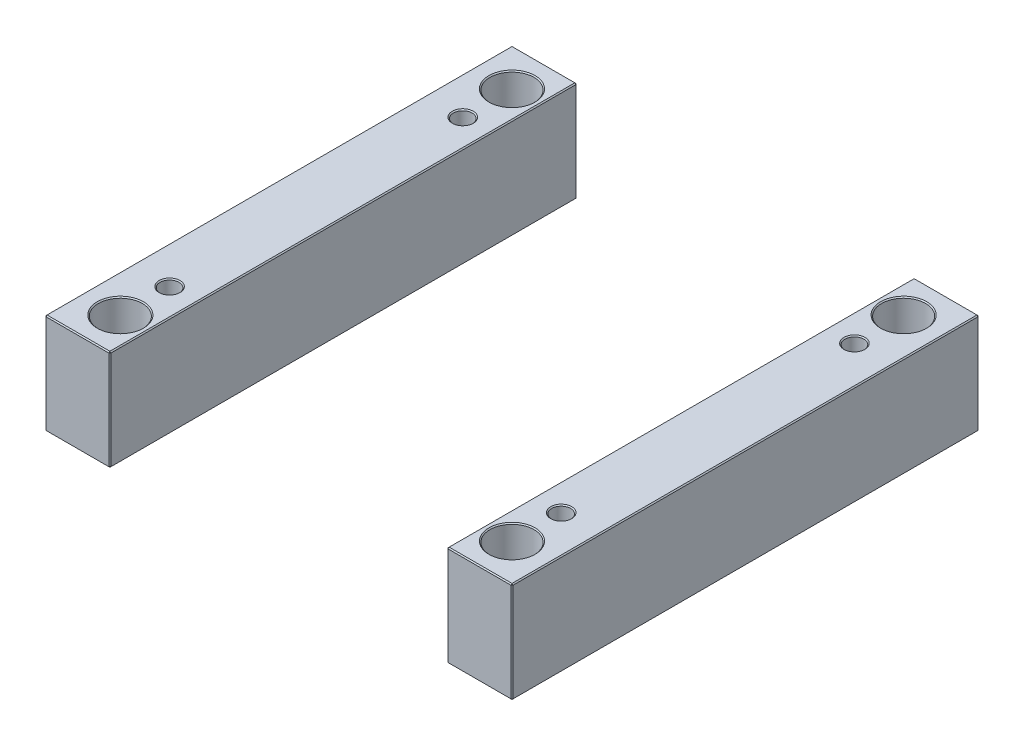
ISO-10303-21;
HEADER;
FILE_DESCRIPTION(('STEP AP214'),'2;1');
FILE_NAME('part.step','',(''),(''),'','','');
FILE_SCHEMA(('AUTOMOTIVE_DESIGN { 1 0 10303 214 1 1 1 1 }'));
ENDSEC;
DATA;
#1=APPLICATION_CONTEXT('core data for automotive mechanical design processes');
#2=APPLICATION_PROTOCOL_DEFINITION('international standard','automotive_design',2000,#1);
#3=PRODUCT_CONTEXT('',#1,'mechanical');
#4=PRODUCT('Part','Part','',(#3));
#5=PRODUCT_RELATED_PRODUCT_CATEGORY('part','',(#4));
#6=PRODUCT_DEFINITION_FORMATION('','',#4);
#7=PRODUCT_DEFINITION_CONTEXT('part definition',#1,'design');
#8=PRODUCT_DEFINITION('design','',#6,#7);
#9=PRODUCT_DEFINITION_SHAPE('','',#8);
#10=(LENGTH_UNIT() NAMED_UNIT(*) SI_UNIT(.MILLI.,.METRE.));
#11=(NAMED_UNIT(*) PLANE_ANGLE_UNIT() SI_UNIT($,.RADIAN.));
#12=(NAMED_UNIT(*) SI_UNIT($,.STERADIAN.) SOLID_ANGLE_UNIT());
#13=UNCERTAINTY_MEASURE_WITH_UNIT(LENGTH_MEASURE(1.E-05),#10,'distance_accuracy_value','');
#14=(GEOMETRIC_REPRESENTATION_CONTEXT(3) GLOBAL_UNCERTAINTY_ASSIGNED_CONTEXT((#13)) GLOBAL_UNIT_ASSIGNED_CONTEXT((#10,
#11,#12)) REPRESENTATION_CONTEXT('',''));
#15=CARTESIAN_POINT('',(0.,0.,0.));
#16=DIRECTION('',(0.,0.,1.));
#17=DIRECTION('',(1.,0.,0.));
#18=AXIS2_PLACEMENT_3D('',#15,#16,#17);
#19=CARTESIAN_POINT('',(-223.,96.,-223.));
#20=DIRECTION('',(0.,0.,1.));
#21=DIRECTION('',(1.,0.,0.));
#22=AXIS2_PLACEMENT_3D('',#19,#20,#21);
#23=PLANE('',#22);
#24=DIRECTION('',(-1.,0.,0.));
#25=VECTOR('',#24,1.);
#26=CARTESIAN_POINT('',(-223.,1.,-223.));
#27=LINE('',#26,#25);
#28=CARTESIAN_POINT('',(-162.,1.,-223.));
#29=VERTEX_POINT('',#28);
#30=CARTESIAN_POINT('',(-222.,1.,-223.));
#31=VERTEX_POINT('',#30);
#32=EDGE_CURVE('P0_E137',#29,#31,#27,.T.);
#33=ORIENTED_EDGE('',*,*,#32,.T.);
#34=DIRECTION('',(0.,1.,0.));
#35=VECTOR('',#34,1.);
#36=CARTESIAN_POINT('',(-222.,96.,-223.));
#37=LINE('',#36,#35);
#38=CARTESIAN_POINT('',(-222.,95.,-223.));
#39=VERTEX_POINT('',#38);
#40=EDGE_CURVE('P0_E265',#31,#39,#37,.T.);
#41=ORIENTED_EDGE('',*,*,#40,.T.);
#42=DIRECTION('',(1.,0.,0.));
#43=VECTOR('',#42,1.);
#44=CARTESIAN_POINT('',(-223.,95.,-223.));
#45=LINE('',#44,#43);
#46=CARTESIAN_POINT('',(-162.,95.,-223.));
#47=VERTEX_POINT('',#46);
#48=EDGE_CURVE('P0_E263',#39,#47,#45,.T.);
#49=ORIENTED_EDGE('',*,*,#48,.T.);
#50=DIRECTION('',(0.,-1.,0.));
#51=VECTOR('',#50,1.);
#52=CARTESIAN_POINT('',(-162.,96.,-223.));
#53=LINE('',#52,#51);
#54=EDGE_CURVE('P0_E260',#47,#29,#53,.T.);
#55=ORIENTED_EDGE('',*,*,#54,.T.);
#56=EDGE_LOOP('',(#33,#41,#49,#55));
#57=FACE_BOUND('',#56,.T.);
#58=ADVANCED_FACE('P0_F16',(#57),#23,.F.);
#59=CARTESIAN_POINT('',(-223.,96.,223.));
#60=DIRECTION('',(1.,0.,0.));
#61=DIRECTION('',(0.,0.,-1.));
#62=AXIS2_PLACEMENT_3D('',#59,#60,#61);
#63=PLANE('',#62);
#64=DIRECTION('',(0.,1.,0.));
#65=VECTOR('',#64,1.);
#66=CARTESIAN_POINT('',(-223.,96.,222.));
#67=LINE('',#66,#65);
#68=CARTESIAN_POINT('',(-223.,1.,222.));
#69=VERTEX_POINT('',#68);
#70=CARTESIAN_POINT('',(-223.,95.,222.));
#71=VERTEX_POINT('',#70);
#72=EDGE_CURVE('P0_E253',#69,#71,#67,.T.);
#73=ORIENTED_EDGE('',*,*,#72,.T.);
#74=DIRECTION('',(0.,0.,-1.));
#75=VECTOR('',#74,1.);
#76=CARTESIAN_POINT('',(-223.,95.,223.));
#77=LINE('',#76,#75);
#78=CARTESIAN_POINT('',(-223.,95.,-222.));
#79=VERTEX_POINT('',#78);
#80=EDGE_CURVE('P0_E258',#71,#79,#77,.T.);
#81=ORIENTED_EDGE('',*,*,#80,.T.);
#82=DIRECTION('',(0.,-1.,0.));
#83=VECTOR('',#82,1.);
#84=CARTESIAN_POINT('',(-223.,96.,-222.));
#85=LINE('',#84,#83);
#86=CARTESIAN_POINT('',(-223.,1.,-222.));
#87=VERTEX_POINT('',#86);
#88=EDGE_CURVE('P0_E255',#79,#87,#85,.T.);
#89=ORIENTED_EDGE('',*,*,#88,.T.);
#90=DIRECTION('',(0.,0.,1.));
#91=VECTOR('',#90,1.);
#92=CARTESIAN_POINT('',(-223.,1.,223.));
#93=LINE('',#92,#91);
#94=EDGE_CURVE('P0_E251',#87,#69,#93,.T.);
#95=ORIENTED_EDGE('',*,*,#94,.T.);
#96=EDGE_LOOP('',(#73,#81,#89,#95));
#97=FACE_BOUND('',#96,.T.);
#98=ADVANCED_FACE('P0_F333',(#97),#63,.F.);
#99=CARTESIAN_POINT('',(-223.,96.,223.));
#100=DIRECTION('',(0.,0.,-1.));
#101=DIRECTION('',(-1.,0.,0.));
#102=AXIS2_PLACEMENT_3D('',#99,#100,#101);
#103=PLANE('',#102);
#104=DIRECTION('',(-1.,0.,0.));
#105=VECTOR('',#104,1.);
#106=CARTESIAN_POINT('',(-223.,95.,223.));
#107=LINE('',#106,#105);
#108=CARTESIAN_POINT('',(-162.,95.,223.));
#109=VERTEX_POINT('',#108);
#110=CARTESIAN_POINT('',(-222.,95.,223.));
#111=VERTEX_POINT('',#110);
#112=EDGE_CURVE('P0_E272',#109,#111,#107,.T.);
#113=ORIENTED_EDGE('',*,*,#112,.T.);
#114=DIRECTION('',(0.,-1.,0.));
#115=VECTOR('',#114,1.);
#116=CARTESIAN_POINT('',(-222.,96.,223.));
#117=LINE('',#116,#115);
#118=CARTESIAN_POINT('',(-222.,1.,223.));
#119=VERTEX_POINT('',#118);
#120=EDGE_CURVE('P0_E274',#111,#119,#117,.T.);
#121=ORIENTED_EDGE('',*,*,#120,.T.);
#122=DIRECTION('',(1.,0.,0.));
#123=VECTOR('',#122,1.);
#124=CARTESIAN_POINT('',(-161.,1.,223.));
#125=LINE('',#124,#123);
#126=CARTESIAN_POINT('',(-162.,1.,223.));
#127=VERTEX_POINT('',#126);
#128=EDGE_CURVE('P0_E270',#119,#127,#125,.T.);
#129=ORIENTED_EDGE('',*,*,#128,.T.);
#130=DIRECTION('',(0.,1.,0.));
#131=VECTOR('',#130,1.);
#132=CARTESIAN_POINT('',(-162.,96.,223.));
#133=LINE('',#132,#131);
#134=EDGE_CURVE('P0_E268',#127,#109,#133,.T.);
#135=ORIENTED_EDGE('',*,*,#134,.T.);
#136=EDGE_LOOP('',(#113,#121,#129,#135));
#137=FACE_BOUND('',#136,.T.);
#138=ADVANCED_FACE('P0_F372',(#137),#103,.F.);
#139=CARTESIAN_POINT('',(-161.,96.,-223.));
#140=DIRECTION('',(-1.,0.,0.));
#141=DIRECTION('',(0.,0.,1.));
#142=AXIS2_PLACEMENT_3D('',#139,#140,#141);
#143=PLANE('',#142);
#144=DIRECTION('',(0.,0.,1.));
#145=VECTOR('',#144,1.);
#146=CARTESIAN_POINT('',(-161.,95.,-223.));
#147=LINE('',#146,#145);
#148=CARTESIAN_POINT('',(-161.,95.,-222.));
#149=VERTEX_POINT('',#148);
#150=CARTESIAN_POINT('',(-161.,95.,222.));
#151=VERTEX_POINT('',#150);
#152=EDGE_CURVE('P0_E31',#149,#151,#147,.T.);
#153=ORIENTED_EDGE('',*,*,#152,.T.);
#154=DIRECTION('',(0.,-1.,0.));
#155=VECTOR('',#154,1.);
#156=CARTESIAN_POINT('',(-161.,96.,222.));
#157=LINE('',#156,#155);
#158=CARTESIAN_POINT('',(-161.,1.,222.));
#159=VERTEX_POINT('',#158);
#160=EDGE_CURVE('P0_E190',#151,#159,#157,.T.);
#161=ORIENTED_EDGE('',*,*,#160,.T.);
#162=DIRECTION('',(0.,0.,-1.));
#163=VECTOR('',#162,1.);
#164=CARTESIAN_POINT('',(-161.,1.,-223.));
#165=LINE('',#164,#163);
#166=CARTESIAN_POINT('',(-161.,1.,-222.));
#167=VERTEX_POINT('',#166);
#168=EDGE_CURVE('P0_E286',#159,#167,#165,.T.);
#169=ORIENTED_EDGE('',*,*,#168,.T.);
#170=DIRECTION('',(0.,1.,0.));
#171=VECTOR('',#170,1.);
#172=CARTESIAN_POINT('',(-161.,96.,-222.));
#173=LINE('',#172,#171);
#174=EDGE_CURVE('P0_E36',#167,#149,#173,.T.);
#175=ORIENTED_EDGE('',*,*,#174,.T.);
#176=EDGE_LOOP('',(#153,#161,#169,#175));
#177=FACE_BOUND('',#176,.T.);
#178=ADVANCED_FACE('P0_F649',(#177),#143,.F.);
#179=CARTESIAN_POINT('',(0.,96.,0.));
#180=DIRECTION('',(0.,-1.,0.));
#181=DIRECTION('',(0.,0.,-1.));
#182=AXIS2_PLACEMENT_3D('',#179,#180,#181);
#183=PLANE('',#182);
#184=CARTESIAN_POINT('',(-187.,96.,-187.));
#185=DIRECTION('',(0.,-1.,0.));
#186=DIRECTION('',(0.,0.,-1.));
#187=AXIS2_PLACEMENT_3D('',#184,#185,#186);
#188=CIRCLE('',#187,22.);
#189=CARTESIAN_POINT('',(-187.,96.,-209.));
#190=VERTEX_POINT('',#189);
#191=EDGE_CURVE('P0_E214',#190,#190,#188,.T.);
#192=ORIENTED_EDGE('',*,*,#191,.T.);
#193=EDGE_LOOP('',(#192));
#194=FACE_BOUND('',#193,.T.);
#195=CARTESIAN_POINT('',(-187.,96.,187.));
#196=DIRECTION('',(0.,-1.,0.));
#197=DIRECTION('',(0.,0.,-1.));
#198=AXIS2_PLACEMENT_3D('',#195,#196,#197);
#199=CIRCLE('',#198,22.);
#200=CARTESIAN_POINT('',(-187.,96.,165.));
#201=VERTEX_POINT('',#200);
#202=EDGE_CURVE('P0_E211',#201,#201,#199,.T.);
#203=ORIENTED_EDGE('',*,*,#202,.T.);
#204=EDGE_LOOP('',(#203));
#205=FACE_BOUND('',#204,.T.);
#206=CARTESIAN_POINT('',(-187.,96.,140.));
#207=DIRECTION('',(0.,-1.,0.));
#208=DIRECTION('',(0.,0.,-1.));
#209=AXIS2_PLACEMENT_3D('',#206,#207,#208);
#210=CIRCLE('',#209,10.);
#211=CARTESIAN_POINT('',(-187.,96.,130.));
#212=VERTEX_POINT('',#211);
#213=EDGE_CURVE('P0_E193',#212,#212,#210,.T.);
#214=ORIENTED_EDGE('',*,*,#213,.T.);
#215=EDGE_LOOP('',(#214));
#216=FACE_BOUND('',#215,.T.);
#217=CARTESIAN_POINT('',(-187.,96.,-140.));
#218=DIRECTION('',(0.,-1.,0.));
#219=DIRECTION('',(0.,0.,-1.));
#220=AXIS2_PLACEMENT_3D('',#217,#218,#219);
#221=CIRCLE('',#220,10.);
#222=CARTESIAN_POINT('',(-187.,96.,-150.));
#223=VERTEX_POINT('',#222);
#224=EDGE_CURVE('P0_E189',#223,#223,#221,.T.);
#225=ORIENTED_EDGE('',*,*,#224,.T.);
#226=EDGE_LOOP('',(#225));
#227=FACE_BOUND('',#226,.T.);
#228=DIRECTION('',(0.,0.,1.));
#229=VECTOR('',#228,1.);
#230=CARTESIAN_POINT('',(-222.,96.,1.38155555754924E-13));
#231=LINE('',#230,#229);
#232=CARTESIAN_POINT('',(-222.,96.,-222.));
#233=VERTEX_POINT('',#232);
#234=CARTESIAN_POINT('',(-222.,96.,222.));
#235=VERTEX_POINT('',#234);
#236=EDGE_CURVE('P0_E281',#233,#235,#231,.T.);
#237=ORIENTED_EDGE('',*,*,#236,.T.);
#238=DIRECTION('',(1.,0.,0.));
#239=VECTOR('',#238,1.);
#240=CARTESIAN_POINT('',(-1.9876573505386E-13,96.,222.));
#241=LINE('',#240,#239);
#242=CARTESIAN_POINT('',(-162.,96.,222.));
#243=VERTEX_POINT('',#242);
#244=EDGE_CURVE('P0_E283',#235,#243,#241,.T.);
#245=ORIENTED_EDGE('',*,*,#244,.T.);
#246=DIRECTION('',(0.,0.,-1.));
#247=VECTOR('',#246,1.);
#248=CARTESIAN_POINT('',(-162.,96.,0.));
#249=LINE('',#248,#247);
#250=CARTESIAN_POINT('',(-162.,96.,-222.));
#251=VERTEX_POINT('',#250);
#252=EDGE_CURVE('P0_E277',#243,#251,#249,.T.);
#253=ORIENTED_EDGE('',*,*,#252,.T.);
#254=DIRECTION('',(-1.,0.,0.));
#255=VECTOR('',#254,1.);
#256=CARTESIAN_POINT('',(2.98148602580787E-13,96.,-222.));
#257=LINE('',#256,#255);
#258=EDGE_CURVE('P0_E279',#251,#233,#257,.T.);
#259=ORIENTED_EDGE('',*,*,#258,.T.);
#260=EDGE_LOOP('',(#237,#245,#253,#259));
#261=FACE_BOUND('',#260,.T.);
#262=ADVANCED_FACE('P0_F229',(#194,#205,#216,#227,#261),#183,.F.);
#263=CARTESIAN_POINT('',(0.,0.,0.));
#264=DIRECTION('',(0.,-1.,0.));
#265=DIRECTION('',(0.,0.,-1.));
#266=AXIS2_PLACEMENT_3D('',#263,#264,#265);
#267=PLANE('',#266);
#268=CARTESIAN_POINT('',(-187.,0.,-187.));
#269=DIRECTION('',(0.,-1.,0.));
#270=DIRECTION('',(0.,0.,-1.));
#271=AXIS2_PLACEMENT_3D('',#268,#269,#270);
#272=CIRCLE('',#271,22.);
#273=CARTESIAN_POINT('',(-187.,0.,-209.));
#274=VERTEX_POINT('',#273);
#275=EDGE_CURVE('P0_E202',#274,#274,#272,.F.);
#276=ORIENTED_EDGE('',*,*,#275,.T.);
#277=EDGE_LOOP('',(#276));
#278=FACE_BOUND('',#277,.T.);
#279=CARTESIAN_POINT('',(-187.,0.,187.));
#280=DIRECTION('',(0.,-1.,0.));
#281=DIRECTION('',(0.,0.,-1.));
#282=AXIS2_PLACEMENT_3D('',#279,#280,#281);
#283=CIRCLE('',#282,22.);
#284=CARTESIAN_POINT('',(-187.,0.,165.));
#285=VERTEX_POINT('',#284);
#286=EDGE_CURVE('P0_E199',#285,#285,#283,.F.);
#287=ORIENTED_EDGE('',*,*,#286,.T.);
#288=EDGE_LOOP('',(#287));
#289=FACE_BOUND('',#288,.T.);
#290=CARTESIAN_POINT('',(-187.,0.,-140.));
#291=DIRECTION('',(0.,-1.,0.));
#292=DIRECTION('',(0.,0.,-1.));
#293=AXIS2_PLACEMENT_3D('',#290,#291,#292);
#294=CIRCLE('',#293,10.);
#295=CARTESIAN_POINT('',(-187.,0.,-150.));
#296=VERTEX_POINT('',#295);
#297=EDGE_CURVE('P0_E235',#296,#296,#294,.F.);
#298=ORIENTED_EDGE('',*,*,#297,.T.);
#299=EDGE_LOOP('',(#298));
#300=FACE_BOUND('',#299,.T.);
#301=CARTESIAN_POINT('',(-187.,0.,140.));
#302=DIRECTION('',(0.,-1.,0.));
#303=DIRECTION('',(0.,0.,-1.));
#304=AXIS2_PLACEMENT_3D('',#301,#302,#303);
#305=CIRCLE('',#304,10.);
#306=CARTESIAN_POINT('',(-187.,0.,130.));
#307=VERTEX_POINT('',#306);
#308=EDGE_CURVE('P0_E238',#307,#307,#305,.F.);
#309=ORIENTED_EDGE('',*,*,#308,.T.);
#310=EDGE_LOOP('',(#309));
#311=FACE_BOUND('',#310,.T.);
#312=DIRECTION('',(-1.,0.,0.));
#313=VECTOR('',#312,1.);
#314=CARTESIAN_POINT('',(-223.,0.,222.));
#315=LINE('',#314,#313);
#316=CARTESIAN_POINT('',(-162.,0.,222.));
#317=VERTEX_POINT('',#316);
#318=CARTESIAN_POINT('',(-222.,0.,222.));
#319=VERTEX_POINT('',#318);
#320=EDGE_CURVE('P0_E114',#317,#319,#315,.T.);
#321=ORIENTED_EDGE('',*,*,#320,.T.);
#322=DIRECTION('',(0.,0.,-1.));
#323=VECTOR('',#322,1.);
#324=CARTESIAN_POINT('',(-222.,0.,-223.));
#325=LINE('',#324,#323);
#326=CARTESIAN_POINT('',(-222.,0.,-222.));
#327=VERTEX_POINT('',#326);
#328=EDGE_CURVE('P0_E110',#319,#327,#325,.T.);
#329=ORIENTED_EDGE('',*,*,#328,.T.);
#330=DIRECTION('',(1.,0.,0.));
#331=VECTOR('',#330,1.);
#332=CARTESIAN_POINT('',(-161.,0.,-222.));
#333=LINE('',#332,#331);
#334=CARTESIAN_POINT('',(-162.,0.,-222.));
#335=VERTEX_POINT('',#334);
#336=EDGE_CURVE('P0_E104',#327,#335,#333,.T.);
#337=ORIENTED_EDGE('',*,*,#336,.T.);
#338=DIRECTION('',(0.,0.,1.));
#339=VECTOR('',#338,1.);
#340=CARTESIAN_POINT('',(-162.,0.,223.));
#341=LINE('',#340,#339);
#342=EDGE_CURVE('P0_E107',#335,#317,#341,.T.);
#343=ORIENTED_EDGE('',*,*,#342,.T.);
#344=EDGE_LOOP('',(#321,#329,#337,#343));
#345=FACE_BOUND('',#344,.T.);
#346=ADVANCED_FACE('P0_F106',(#278,#289,#300,#311,#345),#267,.T.);
#347=CARTESIAN_POINT('',(-187.,0.,-140.));
#348=DIRECTION('',(0.,1.,0.));
#349=DIRECTION('',(0.,0.,1.));
#350=AXIS2_PLACEMENT_3D('',#347,#348,#349);
#351=CYLINDRICAL_SURFACE('',#350,9.);
#352=CARTESIAN_POINT('',(-187.,95.,-140.));
#353=DIRECTION('',(0.,-1.,0.));
#354=DIRECTION('',(0.,0.,-1.));
#355=AXIS2_PLACEMENT_3D('',#352,#353,#354);
#356=CIRCLE('',#355,9.);
#357=CARTESIAN_POINT('',(-187.,95.,-149.));
#358=VERTEX_POINT('',#357);
#359=EDGE_CURVE('P0_E196',#358,#358,#356,.F.);
#360=ORIENTED_EDGE('',*,*,#359,.T.);
#361=EDGE_LOOP('',(#360));
#362=FACE_BOUND('',#361,.T.);
#363=CARTESIAN_POINT('',(-187.,0.999999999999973,-140.));
#364=DIRECTION('',(0.,-1.,0.));
#365=DIRECTION('',(0.,0.,-1.));
#366=AXIS2_PLACEMENT_3D('',#363,#364,#365);
#367=CIRCLE('',#366,9.);
#368=CARTESIAN_POINT('',(-187.,0.999999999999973,-149.));
#369=VERTEX_POINT('',#368);
#370=EDGE_CURVE('P0_E241',#369,#369,#367,.T.);
#371=ORIENTED_EDGE('',*,*,#370,.T.);
#372=EDGE_LOOP('',(#371));
#373=FACE_BOUND('',#372,.T.);
#374=ADVANCED_FACE('P0_F228',(#362,#373),#351,.F.);
#375=CARTESIAN_POINT('',(-187.,0.,140.));
#376=DIRECTION('',(0.,1.,0.));
#377=DIRECTION('',(0.,0.,1.));
#378=AXIS2_PLACEMENT_3D('',#375,#376,#377);
#379=CYLINDRICAL_SURFACE('',#378,9.);
#380=CARTESIAN_POINT('',(-187.,95.,140.));
#381=DIRECTION('',(0.,-1.,0.));
#382=DIRECTION('',(0.,0.,-1.));
#383=AXIS2_PLACEMENT_3D('',#380,#381,#382);
#384=CIRCLE('',#383,9.);
#385=CARTESIAN_POINT('',(-187.,95.,131.));
#386=VERTEX_POINT('',#385);
#387=EDGE_CURVE('P0_E186',#386,#386,#384,.F.);
#388=ORIENTED_EDGE('',*,*,#387,.T.);
#389=EDGE_LOOP('',(#388));
#390=FACE_BOUND('',#389,.T.);
#391=CARTESIAN_POINT('',(-187.,0.999999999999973,140.));
#392=DIRECTION('',(0.,-1.,0.));
#393=DIRECTION('',(0.,0.,-1.));
#394=AXIS2_PLACEMENT_3D('',#391,#392,#393);
#395=CIRCLE('',#394,9.);
#396=CARTESIAN_POINT('',(-187.,0.999999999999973,131.));
#397=VERTEX_POINT('',#396);
#398=EDGE_CURVE('P0_E248',#397,#397,#395,.T.);
#399=ORIENTED_EDGE('',*,*,#398,.T.);
#400=EDGE_LOOP('',(#399));
#401=FACE_BOUND('',#400,.T.);
#402=ADVANCED_FACE('P0_F380',(#390,#401),#379,.F.);
#403=CARTESIAN_POINT('',(-187.,0.,-140.));
#404=DIRECTION('',(0.,-1.,0.));
#405=DIRECTION('',(0.,0.,-1.));
#406=AXIS2_PLACEMENT_3D('',#403,#404,#405);
#407=CONICAL_SURFACE('',#406,10.,0.78539816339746);
#408=ORIENTED_EDGE('',*,*,#370,.F.);
#409=EDGE_LOOP('',(#408));
#410=FACE_BOUND('',#409,.T.);
#411=ORIENTED_EDGE('',*,*,#297,.F.);
#412=EDGE_LOOP('',(#411));
#413=FACE_BOUND('',#412,.T.);
#414=ADVANCED_FACE('P0_F376',(#410,#413),#407,.F.);
#415=CARTESIAN_POINT('',(-187.,0.,140.));
#416=DIRECTION('',(0.,-1.,0.));
#417=DIRECTION('',(0.,0.,-1.));
#418=AXIS2_PLACEMENT_3D('',#415,#416,#417);
#419=CONICAL_SURFACE('',#418,10.,0.78539816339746);
#420=ORIENTED_EDGE('',*,*,#398,.F.);
#421=EDGE_LOOP('',(#420));
#422=FACE_BOUND('',#421,.T.);
#423=ORIENTED_EDGE('',*,*,#308,.F.);
#424=EDGE_LOOP('',(#423));
#425=FACE_BOUND('',#424,.T.);
#426=ADVANCED_FACE('P0_F379',(#422,#425),#419,.F.);
#427=CARTESIAN_POINT('',(-161.,96.,222.));
#428=DIRECTION('',(-0.707106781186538,0.,-0.707106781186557));
#429=DIRECTION('',(0.,-1.,0.));
#430=AXIS2_PLACEMENT_3D('',#427,#428,#429);
#431=PLANE('',#430);
#432=DIRECTION('',(-0.707106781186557,0.,0.707106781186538));
#433=VECTOR('',#432,1.);
#434=CARTESIAN_POINT('',(-161.5,95.,222.5));
#435=LINE('',#434,#433);
#436=EDGE_CURVE('P0_E125',#109,#151,#435,.F.);
#437=ORIENTED_EDGE('',*,*,#436,.F.);
#438=ORIENTED_EDGE('',*,*,#134,.F.);
#439=DIRECTION('',(0.707106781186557,0.,-0.707106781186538));
#440=VECTOR('',#439,1.);
#441=CARTESIAN_POINT('',(-162.,1.,223.));
#442=LINE('',#441,#440);
#443=EDGE_CURVE('P0_E181',#159,#127,#442,.F.);
#444=ORIENTED_EDGE('',*,*,#443,.F.);
#445=ORIENTED_EDGE('',*,*,#160,.F.);
#446=EDGE_LOOP('',(#437,#438,#444,#445));
#447=FACE_BOUND('',#446,.T.);
#448=ADVANCED_FACE('P0_F384',(#447),#431,.F.);
#449=CARTESIAN_POINT('',(-162.,96.,222.));
#450=DIRECTION('',(0.577350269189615,0.577350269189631,0.577350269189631));
#451=DIRECTION('',(0.,-0.707106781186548,0.707106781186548));
#452=AXIS2_PLACEMENT_3D('',#449,#450,#451);
#453=PLANE('',#452);
#454=DIRECTION('',(0.,0.707106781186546,-0.707106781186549));
#455=VECTOR('',#454,1.);
#456=CARTESIAN_POINT('',(-162.,96.,222.));
#457=LINE('',#456,#455);
#458=EDGE_CURVE('P0_E175',#109,#243,#457,.T.);
#459=ORIENTED_EDGE('',*,*,#458,.F.);
#460=ORIENTED_EDGE('',*,*,#436,.T.);
#461=DIRECTION('',(0.707106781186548,-0.707106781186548,0.));
#462=VECTOR('',#461,1.);
#463=CARTESIAN_POINT('',(-162.,96.,222.));
#464=LINE('',#463,#462);
#465=EDGE_CURVE('P0_E178',#243,#151,#464,.T.);
#466=ORIENTED_EDGE('',*,*,#465,.F.);
#467=EDGE_LOOP('',(#459,#460,#466));
#468=FACE_BOUND('',#467,.T.);
#469=ADVANCED_FACE('P0_F588',(#468),#453,.T.);
#470=CARTESIAN_POINT('',(-162.,1.,223.));
#471=DIRECTION('',(0.577350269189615,-0.577350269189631,0.577350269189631));
#472=DIRECTION('',(0.,-0.707106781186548,-0.707106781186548));
#473=AXIS2_PLACEMENT_3D('',#470,#471,#472);
#474=PLANE('',#473);
#475=DIRECTION('',(0.707106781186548,0.707106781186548,0.));
#476=VECTOR('',#475,1.);
#477=CARTESIAN_POINT('',(-161.5,0.500000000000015,222.));
#478=LINE('',#477,#476);
#479=EDGE_CURVE('P0_E123',#159,#317,#478,.F.);
#480=ORIENTED_EDGE('',*,*,#479,.F.);
#481=ORIENTED_EDGE('',*,*,#443,.T.);
#482=DIRECTION('',(0.,-0.707106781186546,-0.707106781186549));
#483=VECTOR('',#482,1.);
#484=CARTESIAN_POINT('',(-162.,1.,223.));
#485=LINE('',#484,#483);
#486=EDGE_CURVE('P0_E172',#317,#127,#485,.F.);
#487=ORIENTED_EDGE('',*,*,#486,.F.);
#488=EDGE_LOOP('',(#480,#481,#487));
#489=FACE_BOUND('',#488,.T.);
#490=ADVANCED_FACE('P0_F597',(#489),#474,.T.);
#491=CARTESIAN_POINT('',(-162.,96.,0.));
#492=DIRECTION('',(-0.707106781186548,-0.707106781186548,0.));
#493=DIRECTION('',(0.,0.,-1.));
#494=AXIS2_PLACEMENT_3D('',#491,#492,#493);
#495=PLANE('',#494);
#496=ORIENTED_EDGE('',*,*,#465,.T.);
#497=ORIENTED_EDGE('',*,*,#152,.F.);
#498=DIRECTION('',(-0.707106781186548,0.707106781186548,0.));
#499=VECTOR('',#498,1.);
#500=CARTESIAN_POINT('',(-161.5,95.5,-222.));
#501=LINE('',#500,#499);
#502=EDGE_CURVE('P0_E165',#251,#149,#501,.F.);
#503=ORIENTED_EDGE('',*,*,#502,.F.);
#504=ORIENTED_EDGE('',*,*,#252,.F.);
#505=EDGE_LOOP('',(#496,#497,#503,#504));
#506=FACE_BOUND('',#505,.T.);
#507=ADVANCED_FACE('P0_F349',(#506),#495,.F.);
#508=CARTESIAN_POINT('',(-1.9876573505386E-13,96.,222.));
#509=DIRECTION('',(0.,-0.707106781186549,-0.707106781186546));
#510=DIRECTION('',(1.,0.,0.));
#511=AXIS2_PLACEMENT_3D('',#508,#509,#510);
#512=PLANE('',#511);
#513=ORIENTED_EDGE('',*,*,#458,.T.);
#514=ORIENTED_EDGE('',*,*,#244,.F.);
#515=DIRECTION('',(0.,-0.707106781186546,0.707106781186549));
#516=VECTOR('',#515,1.);
#517=CARTESIAN_POINT('',(-222.,95.5,222.5));
#518=LINE('',#517,#516);
#519=EDGE_CURVE('P0_E162',#111,#235,#518,.F.);
#520=ORIENTED_EDGE('',*,*,#519,.F.);
#521=ORIENTED_EDGE('',*,*,#112,.F.);
#522=EDGE_LOOP('',(#513,#514,#520,#521));
#523=FACE_BOUND('',#522,.T.);
#524=ADVANCED_FACE('P0_F344',(#523),#512,.F.);
#525=CARTESIAN_POINT('',(-222.,96.,223.));
#526=DIRECTION('',(0.707106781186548,0.,-0.707106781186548));
#527=DIRECTION('',(0.,-1.,0.));
#528=AXIS2_PLACEMENT_3D('',#525,#526,#527);
#529=PLANE('',#528);
#530=DIRECTION('',(0.707106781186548,0.,0.707106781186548));
#531=VECTOR('',#530,1.);
#532=CARTESIAN_POINT('',(-222.,1.,223.));
#533=LINE('',#532,#531);
#534=EDGE_CURVE('P0_E156',#119,#69,#533,.F.);
#535=ORIENTED_EDGE('',*,*,#534,.F.);
#536=ORIENTED_EDGE('',*,*,#120,.F.);
#537=DIRECTION('',(-0.707106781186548,0.,-0.707106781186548));
#538=VECTOR('',#537,1.);
#539=CARTESIAN_POINT('',(-223.,95.,222.));
#540=LINE('',#539,#538);
#541=EDGE_CURVE('P0_E159',#71,#111,#540,.F.);
#542=ORIENTED_EDGE('',*,*,#541,.F.);
#543=ORIENTED_EDGE('',*,*,#72,.F.);
#544=EDGE_LOOP('',(#535,#536,#542,#543));
#545=FACE_BOUND('',#544,.T.);
#546=ADVANCED_FACE('P0_F338',(#545),#529,.F.);
#547=CARTESIAN_POINT('',(-223.,1.,223.));
#548=DIRECTION('',(0.,-0.707106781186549,0.707106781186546));
#549=DIRECTION('',(-1.,0.,0.));
#550=AXIS2_PLACEMENT_3D('',#547,#548,#549);
#551=PLANE('',#550);
#552=ORIENTED_EDGE('',*,*,#486,.T.);
#553=ORIENTED_EDGE('',*,*,#128,.F.);
#554=DIRECTION('',(0.,0.707106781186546,0.707106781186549));
#555=VECTOR('',#554,1.);
#556=CARTESIAN_POINT('',(-222.,1.,223.));
#557=LINE('',#556,#555);
#558=EDGE_CURVE('P0_E134',#319,#119,#557,.T.);
#559=ORIENTED_EDGE('',*,*,#558,.F.);
#560=ORIENTED_EDGE('',*,*,#320,.F.);
#561=EDGE_LOOP('',(#552,#553,#559,#560));
#562=FACE_BOUND('',#561,.T.);
#563=ADVANCED_FACE('P0_F364',(#562),#551,.T.);
#564=CARTESIAN_POINT('',(-161.,1.,-223.));
#565=DIRECTION('',(0.707106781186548,-0.707106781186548,0.));
#566=DIRECTION('',(0.,0.,1.));
#567=AXIS2_PLACEMENT_3D('',#564,#565,#566);
#568=PLANE('',#567);
#569=ORIENTED_EDGE('',*,*,#479,.T.);
#570=ORIENTED_EDGE('',*,*,#342,.F.);
#571=DIRECTION('',(-0.707106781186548,-0.707106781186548,0.));
#572=VECTOR('',#571,1.);
#573=CARTESIAN_POINT('',(-162.,0.,-222.));
#574=LINE('',#573,#572);
#575=EDGE_CURVE('P0_E120',#167,#335,#574,.T.);
#576=ORIENTED_EDGE('',*,*,#575,.F.);
#577=ORIENTED_EDGE('',*,*,#168,.F.);
#578=EDGE_LOOP('',(#569,#570,#576,#577));
#579=FACE_BOUND('',#578,.T.);
#580=ADVANCED_FACE('P0_F119',(#579),#568,.T.);
#581=CARTESIAN_POINT('',(-162.,96.,-223.));
#582=DIRECTION('',(-0.707106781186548,0.,0.707106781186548));
#583=DIRECTION('',(0.,-1.,0.));
#584=AXIS2_PLACEMENT_3D('',#581,#582,#583);
#585=PLANE('',#584);
#586=DIRECTION('',(0.707106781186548,0.,0.707106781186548));
#587=VECTOR('',#586,1.);
#588=CARTESIAN_POINT('',(-162.,95.,-223.));
#589=LINE('',#588,#587);
#590=EDGE_CURVE('P0_E168',#149,#47,#589,.F.);
#591=ORIENTED_EDGE('',*,*,#590,.F.);
#592=ORIENTED_EDGE('',*,*,#174,.F.);
#593=DIRECTION('',(-0.707106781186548,0.,-0.707106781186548));
#594=VECTOR('',#593,1.);
#595=CARTESIAN_POINT('',(-161.5,1.,-222.5));
#596=LINE('',#595,#594);
#597=EDGE_CURVE('P0_E133',#29,#167,#596,.F.);
#598=ORIENTED_EDGE('',*,*,#597,.F.);
#599=ORIENTED_EDGE('',*,*,#54,.F.);
#600=EDGE_LOOP('',(#591,#592,#598,#599));
#601=FACE_BOUND('',#600,.T.);
#602=ADVANCED_FACE('P0_F354',(#601),#585,.F.);
#603=CARTESIAN_POINT('',(-162.,95.,-223.));
#604=DIRECTION('',(0.577350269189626,0.577350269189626,-0.577350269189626));
#605=DIRECTION('',(-0.707106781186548,0.,-0.707106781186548));
#606=AXIS2_PLACEMENT_3D('',#603,#604,#605);
#607=PLANE('',#606);
#608=ORIENTED_EDGE('',*,*,#502,.T.);
#609=ORIENTED_EDGE('',*,*,#590,.T.);
#610=DIRECTION('',(0.,-0.707106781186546,-0.70710678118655));
#611=VECTOR('',#610,1.);
#612=CARTESIAN_POINT('',(-162.,95.,-223.));
#613=LINE('',#612,#611);
#614=EDGE_CURVE('P0_E151',#251,#47,#613,.T.);
#615=ORIENTED_EDGE('',*,*,#614,.F.);
#616=EDGE_LOOP('',(#608,#609,#615));
#617=FACE_BOUND('',#616,.T.);
#618=ADVANCED_FACE('P0_F352',(#617),#607,.T.);
#619=CARTESIAN_POINT('',(-223.,95.,222.));
#620=DIRECTION('',(-0.577350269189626,0.577350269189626,0.577350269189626));
#621=DIRECTION('',(0.707106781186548,0.,0.707106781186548));
#622=AXIS2_PLACEMENT_3D('',#619,#620,#621);
#623=PLANE('',#622);
#624=ORIENTED_EDGE('',*,*,#541,.T.);
#625=ORIENTED_EDGE('',*,*,#519,.T.);
#626=DIRECTION('',(0.707106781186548,0.707106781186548,0.));
#627=VECTOR('',#626,1.);
#628=CARTESIAN_POINT('',(-223.,95.,222.));
#629=LINE('',#628,#627);
#630=EDGE_CURVE('P0_E142',#71,#235,#629,.T.);
#631=ORIENTED_EDGE('',*,*,#630,.F.);
#632=EDGE_LOOP('',(#624,#625,#631));
#633=FACE_BOUND('',#632,.T.);
#634=ADVANCED_FACE('P0_F341',(#633),#623,.T.);
#635=CARTESIAN_POINT('',(-222.,1.,223.));
#636=DIRECTION('',(-0.577350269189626,-0.577350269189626,0.577350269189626));
#637=DIRECTION('',(0.707106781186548,0.,0.707106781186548));
#638=AXIS2_PLACEMENT_3D('',#635,#636,#637);
#639=PLANE('',#638);
#640=ORIENTED_EDGE('',*,*,#558,.T.);
#641=ORIENTED_EDGE('',*,*,#534,.T.);
#642=DIRECTION('',(0.707106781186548,-0.707106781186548,0.));
#643=VECTOR('',#642,1.);
#644=CARTESIAN_POINT('',(-222.5,0.5,222.));
#645=LINE('',#644,#643);
#646=EDGE_CURVE('P0_E138',#319,#69,#645,.F.);
#647=ORIENTED_EDGE('',*,*,#646,.F.);
#648=EDGE_LOOP('',(#640,#641,#647));
#649=FACE_BOUND('',#648,.T.);
#650=ADVANCED_FACE('P0_F403',(#649),#639,.T.);
#651=CARTESIAN_POINT('',(-162.,0.,-222.));
#652=DIRECTION('',(0.577350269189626,-0.577350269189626,-0.577350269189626));
#653=DIRECTION('',(-0.707106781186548,0.,-0.707106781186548));
#654=AXIS2_PLACEMENT_3D('',#651,#652,#653);
#655=PLANE('',#654);
#656=ORIENTED_EDGE('',*,*,#597,.T.);
#657=ORIENTED_EDGE('',*,*,#575,.T.);
#658=DIRECTION('',(0.,0.707106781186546,-0.70710678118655));
#659=VECTOR('',#658,1.);
#660=CARTESIAN_POINT('',(-162.,0.,-222.));
#661=LINE('',#660,#659);
#662=EDGE_CURVE('P0_E130',#29,#335,#661,.F.);
#663=ORIENTED_EDGE('',*,*,#662,.F.);
#664=EDGE_LOOP('',(#656,#657,#663));
#665=FACE_BOUND('',#664,.T.);
#666=ADVANCED_FACE('P0_F129',(#665),#655,.T.);
#667=CARTESIAN_POINT('',(2.98148602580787E-13,96.,-222.));
#668=DIRECTION('',(0.,-0.70710678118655,0.707106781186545));
#669=DIRECTION('',(-1.,0.,0.));
#670=AXIS2_PLACEMENT_3D('',#667,#668,#669);
#671=PLANE('',#670);
#672=ORIENTED_EDGE('',*,*,#614,.T.);
#673=ORIENTED_EDGE('',*,*,#48,.F.);
#674=DIRECTION('',(0.,0.707106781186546,0.707106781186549));
#675=VECTOR('',#674,1.);
#676=CARTESIAN_POINT('',(-222.,95.,-223.));
#677=LINE('',#676,#675);
#678=EDGE_CURVE('P0_E139',#233,#39,#677,.F.);
#679=ORIENTED_EDGE('',*,*,#678,.F.);
#680=ORIENTED_EDGE('',*,*,#258,.F.);
#681=EDGE_LOOP('',(#672,#673,#679,#680));
#682=FACE_BOUND('',#681,.T.);
#683=ADVANCED_FACE('P0_F316',(#682),#671,.F.);
#684=CARTESIAN_POINT('',(-222.,96.,1.38155555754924E-13));
#685=DIRECTION('',(0.707106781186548,-0.707106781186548,0.));
#686=DIRECTION('',(0.,0.,1.));
#687=AXIS2_PLACEMENT_3D('',#684,#685,#686);
#688=PLANE('',#687);
#689=ORIENTED_EDGE('',*,*,#630,.T.);
#690=ORIENTED_EDGE('',*,*,#236,.F.);
#691=DIRECTION('',(-0.707106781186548,-0.707106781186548,0.));
#692=VECTOR('',#691,1.);
#693=CARTESIAN_POINT('',(-222.5,95.5,-222.));
#694=LINE('',#693,#692);
#695=EDGE_CURVE('P0_E145',#79,#233,#694,.F.);
#696=ORIENTED_EDGE('',*,*,#695,.F.);
#697=ORIENTED_EDGE('',*,*,#80,.F.);
#698=EDGE_LOOP('',(#689,#690,#696,#697));
#699=FACE_BOUND('',#698,.T.);
#700=ADVANCED_FACE('P0_F310',(#699),#688,.F.);
#701=CARTESIAN_POINT('',(-223.,1.,223.));
#702=DIRECTION('',(-0.707106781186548,-0.707106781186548,0.));
#703=DIRECTION('',(0.,0.,-1.));
#704=AXIS2_PLACEMENT_3D('',#701,#702,#703);
#705=PLANE('',#704);
#706=ORIENTED_EDGE('',*,*,#646,.T.);
#707=ORIENTED_EDGE('',*,*,#94,.F.);
#708=DIRECTION('',(-0.707106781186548,0.707106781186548,0.));
#709=VECTOR('',#708,1.);
#710=CARTESIAN_POINT('',(-223.,1.,-222.));
#711=LINE('',#710,#709);
#712=EDGE_CURVE('P0_E297',#327,#87,#711,.T.);
#713=ORIENTED_EDGE('',*,*,#712,.F.);
#714=ORIENTED_EDGE('',*,*,#328,.F.);
#715=EDGE_LOOP('',(#706,#707,#713,#714));
#716=FACE_BOUND('',#715,.T.);
#717=ADVANCED_FACE('P0_F329',(#716),#705,.T.);
#718=CARTESIAN_POINT('',(-223.,1.,-223.));
#719=DIRECTION('',(0.,-0.70710678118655,-0.707106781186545));
#720=DIRECTION('',(1.,0.,0.));
#721=AXIS2_PLACEMENT_3D('',#718,#719,#720);
#722=PLANE('',#721);
#723=ORIENTED_EDGE('',*,*,#662,.T.);
#724=ORIENTED_EDGE('',*,*,#336,.F.);
#725=DIRECTION('',(0.,-0.707106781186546,0.707106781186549));
#726=VECTOR('',#725,1.);
#727=CARTESIAN_POINT('',(-222.,0.5,-222.5));
#728=LINE('',#727,#726);
#729=EDGE_CURVE('P0_E295',#31,#327,#728,.T.);
#730=ORIENTED_EDGE('',*,*,#729,.F.);
#731=ORIENTED_EDGE('',*,*,#32,.F.);
#732=EDGE_LOOP('',(#723,#724,#730,#731));
#733=FACE_BOUND('',#732,.T.);
#734=ADVANCED_FACE('P0_F136',(#733),#722,.T.);
#735=CARTESIAN_POINT('',(-222.,95.,-223.));
#736=DIRECTION('',(-0.577350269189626,0.577350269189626,-0.577350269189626));
#737=DIRECTION('',(-0.707106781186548,0.,0.707106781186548));
#738=AXIS2_PLACEMENT_3D('',#735,#736,#737);
#739=PLANE('',#738);
#740=ORIENTED_EDGE('',*,*,#695,.T.);
#741=ORIENTED_EDGE('',*,*,#678,.T.);
#742=DIRECTION('',(0.707106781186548,0.,-0.707106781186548));
#743=VECTOR('',#742,1.);
#744=CARTESIAN_POINT('',(-222.,95.,-223.));
#745=LINE('',#744,#743);
#746=EDGE_CURVE('P0_E293',#79,#39,#745,.T.);
#747=ORIENTED_EDGE('',*,*,#746,.F.);
#748=EDGE_LOOP('',(#740,#741,#747));
#749=FACE_BOUND('',#748,.T.);
#750=ADVANCED_FACE('P0_F303',(#749),#739,.T.);
#751=CARTESIAN_POINT('',(-223.,1.,-222.));
#752=DIRECTION('',(-0.577350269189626,-0.577350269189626,-0.577350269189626));
#753=DIRECTION('',(-0.707106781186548,0.,0.707106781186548));
#754=AXIS2_PLACEMENT_3D('',#751,#752,#753);
#755=PLANE('',#754);
#756=ORIENTED_EDGE('',*,*,#729,.T.);
#757=ORIENTED_EDGE('',*,*,#712,.T.);
#758=DIRECTION('',(-0.707106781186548,0.,0.707106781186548));
#759=VECTOR('',#758,1.);
#760=CARTESIAN_POINT('',(-223.,1.,-222.));
#761=LINE('',#760,#759);
#762=EDGE_CURVE('P0_E291',#31,#87,#761,.T.);
#763=ORIENTED_EDGE('',*,*,#762,.F.);
#764=EDGE_LOOP('',(#756,#757,#763));
#765=FACE_BOUND('',#764,.T.);
#766=ADVANCED_FACE('P0_F325',(#765),#755,.T.);
#767=CARTESIAN_POINT('',(-223.,96.,-222.));
#768=DIRECTION('',(0.707106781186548,0.,0.707106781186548));
#769=DIRECTION('',(0.,-1.,0.));
#770=AXIS2_PLACEMENT_3D('',#767,#768,#769);
#771=PLANE('',#770);
#772=ORIENTED_EDGE('',*,*,#746,.T.);
#773=ORIENTED_EDGE('',*,*,#40,.F.);
#774=ORIENTED_EDGE('',*,*,#762,.T.);
#775=ORIENTED_EDGE('',*,*,#88,.F.);
#776=EDGE_LOOP('',(#772,#773,#774,#775));
#777=FACE_BOUND('',#776,.T.);
#778=ADVANCED_FACE('P0_F323',(#777),#771,.F.);
#779=CARTESIAN_POINT('',(-187.,95.,140.));
#780=DIRECTION('',(0.,1.,0.));
#781=DIRECTION('',(0.,0.,1.));
#782=AXIS2_PLACEMENT_3D('',#779,#780,#781);
#783=CONICAL_SURFACE('',#782,9.,0.78539816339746);
#784=ORIENTED_EDGE('',*,*,#213,.F.);
#785=EDGE_LOOP('',(#784));
#786=FACE_BOUND('',#785,.T.);
#787=ORIENTED_EDGE('',*,*,#387,.F.);
#788=EDGE_LOOP('',(#787));
#789=FACE_BOUND('',#788,.T.);
#790=ADVANCED_FACE('P0_F388',(#786,#789),#783,.F.);
#791=CARTESIAN_POINT('',(-187.,95.,-140.));
#792=DIRECTION('',(0.,1.,0.));
#793=DIRECTION('',(0.,0.,1.));
#794=AXIS2_PLACEMENT_3D('',#791,#792,#793);
#795=CONICAL_SURFACE('',#794,9.,0.78539816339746);
#796=ORIENTED_EDGE('',*,*,#224,.F.);
#797=EDGE_LOOP('',(#796));
#798=FACE_BOUND('',#797,.T.);
#799=ORIENTED_EDGE('',*,*,#359,.F.);
#800=EDGE_LOOP('',(#799));
#801=FACE_BOUND('',#800,.T.);
#802=ADVANCED_FACE('P0_F470',(#798,#801),#795,.F.);
#803=CARTESIAN_POINT('',(-187.,0.,187.));
#804=DIRECTION('',(0.,1.,0.));
#805=DIRECTION('',(0.,0.,1.));
#806=AXIS2_PLACEMENT_3D('',#803,#804,#805);
#807=CYLINDRICAL_SURFACE('',#806,21.);
#808=CARTESIAN_POINT('',(-187.,95.,187.));
#809=DIRECTION('',(0.,-1.,0.));
#810=DIRECTION('',(0.,0.,-1.));
#811=AXIS2_PLACEMENT_3D('',#808,#809,#810);
#812=CIRCLE('',#811,21.);
#813=CARTESIAN_POINT('',(-187.,95.,166.));
#814=VERTEX_POINT('',#813);
#815=EDGE_CURVE('P0_E10',#814,#814,#812,.F.);
#816=ORIENTED_EDGE('',*,*,#815,.T.);
#817=EDGE_LOOP('',(#816));
#818=FACE_BOUND('',#817,.T.);
#819=CARTESIAN_POINT('',(-187.,1.00000000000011,187.));
#820=DIRECTION('',(0.,-1.,0.));
#821=DIRECTION('',(0.,0.,-1.));
#822=AXIS2_PLACEMENT_3D('',#819,#820,#821);
#823=CIRCLE('',#822,21.);
#824=CARTESIAN_POINT('',(-187.,1.00000000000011,166.));
#825=VERTEX_POINT('',#824);
#826=EDGE_CURVE('P0_E24',#825,#825,#823,.T.);
#827=ORIENTED_EDGE('',*,*,#826,.T.);
#828=EDGE_LOOP('',(#827));
#829=FACE_BOUND('',#828,.T.);
#830=ADVANCED_FACE('P0_F219',(#818,#829),#807,.F.);
#831=CARTESIAN_POINT('',(-187.,0.,-187.));
#832=DIRECTION('',(0.,1.,0.));
#833=DIRECTION('',(0.,0.,1.));
#834=AXIS2_PLACEMENT_3D('',#831,#832,#833);
#835=CYLINDRICAL_SURFACE('',#834,21.);
#836=CARTESIAN_POINT('',(-187.,0.999999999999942,-187.));
#837=DIRECTION('',(0.,-1.,0.));
#838=DIRECTION('',(0.,0.,-1.));
#839=AXIS2_PLACEMENT_3D('',#836,#837,#838);
#840=CIRCLE('',#839,21.);
#841=CARTESIAN_POINT('',(-187.,0.999999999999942,-208.));
#842=VERTEX_POINT('',#841);
#843=EDGE_CURVE('P0_E208',#842,#842,#840,.T.);
#844=ORIENTED_EDGE('',*,*,#843,.T.);
#845=EDGE_LOOP('',(#844));
#846=FACE_BOUND('',#845,.T.);
#847=CARTESIAN_POINT('',(-187.,95.,-187.));
#848=DIRECTION('',(0.,-1.,0.));
#849=DIRECTION('',(0.,0.,-1.));
#850=AXIS2_PLACEMENT_3D('',#847,#848,#849);
#851=CIRCLE('',#850,21.);
#852=CARTESIAN_POINT('',(-187.,95.,-208.));
#853=VERTEX_POINT('',#852);
#854=EDGE_CURVE('P0_E205',#853,#853,#851,.F.);
#855=ORIENTED_EDGE('',*,*,#854,.T.);
#856=EDGE_LOOP('',(#855));
#857=FACE_BOUND('',#856,.T.);
#858=ADVANCED_FACE('P0_F487',(#846,#857),#835,.F.);
#859=CARTESIAN_POINT('',(-187.,0.,-187.));
#860=DIRECTION('',(0.,-1.,0.));
#861=DIRECTION('',(0.,0.,-1.));
#862=AXIS2_PLACEMENT_3D('',#859,#860,#861);
#863=CONICAL_SURFACE('',#862,22.,0.785398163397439);
#864=ORIENTED_EDGE('',*,*,#843,.F.);
#865=EDGE_LOOP('',(#864));
#866=FACE_BOUND('',#865,.T.);
#867=ORIENTED_EDGE('',*,*,#275,.F.);
#868=EDGE_LOOP('',(#867));
#869=FACE_BOUND('',#868,.T.);
#870=ADVANCED_FACE('P0_F496',(#866,#869),#863,.F.);
#871=CARTESIAN_POINT('',(-187.,95.,-187.));
#872=DIRECTION('',(0.,1.,0.));
#873=DIRECTION('',(0.,0.,1.));
#874=AXIS2_PLACEMENT_3D('',#871,#872,#873);
#875=CONICAL_SURFACE('',#874,21.,0.785398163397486);
#876=ORIENTED_EDGE('',*,*,#191,.F.);
#877=EDGE_LOOP('',(#876));
#878=FACE_BOUND('',#877,.T.);
#879=ORIENTED_EDGE('',*,*,#854,.F.);
#880=EDGE_LOOP('',(#879));
#881=FACE_BOUND('',#880,.T.);
#882=ADVANCED_FACE('P0_F505',(#878,#881),#875,.F.);
#883=CARTESIAN_POINT('',(-187.,95.,187.));
#884=DIRECTION('',(0.,1.,0.));
#885=DIRECTION('',(0.,0.,1.));
#886=AXIS2_PLACEMENT_3D('',#883,#884,#885);
#887=CONICAL_SURFACE('',#886,21.,0.785398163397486);
#888=ORIENTED_EDGE('',*,*,#202,.F.);
#889=EDGE_LOOP('',(#888));
#890=FACE_BOUND('',#889,.T.);
#891=ORIENTED_EDGE('',*,*,#815,.F.);
#892=EDGE_LOOP('',(#891));
#893=FACE_BOUND('',#892,.T.);
#894=ADVANCED_FACE('P0_F223',(#890,#893),#887,.F.);
#895=CARTESIAN_POINT('',(-187.,0.,187.));
#896=DIRECTION('',(0.,-1.,0.));
#897=DIRECTION('',(0.,0.,-1.));
#898=AXIS2_PLACEMENT_3D('',#895,#896,#897);
#899=CONICAL_SURFACE('',#898,22.,0.785398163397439);
#900=ORIENTED_EDGE('',*,*,#826,.F.);
#901=EDGE_LOOP('',(#900));
#902=FACE_BOUND('',#901,.T.);
#903=ORIENTED_EDGE('',*,*,#286,.F.);
#904=EDGE_LOOP('',(#903));
#905=FACE_BOUND('',#904,.T.);
#906=ADVANCED_FACE('P0_F18',(#902,#905),#899,.F.);
#907=CLOSED_SHELL('',(#58,#98,#138,#178,#262,#346,#374,#402,#414,#426,#448,#469,#490,#507,#524,
#546,#563,#580,#602,#618,#634,#650,#666,#683,#700,#717,#734,#750,#766,#778,#790,#802,#830,#858,
#870,#882,#894,#906));
#908=MANIFOLD_SOLID_BREP('P0_B1',#907);
#909=CARTESIAN_POINT('',(223.,96.,223.));
#910=DIRECTION('',(0.,0.,-1.));
#911=DIRECTION('',(-1.,0.,0.));
#912=AXIS2_PLACEMENT_3D('',#909,#910,#911);
#913=PLANE('',#912);
#914=DIRECTION('',(0.,-1.,0.));
#915=VECTOR('',#914,1.);
#916=CARTESIAN_POINT('',(162.,96.,223.));
#917=LINE('',#916,#915);
#918=CARTESIAN_POINT('',(162.,95.,223.));
#919=VERTEX_POINT('',#918);
#920=CARTESIAN_POINT('',(162.,1.,223.));
#921=VERTEX_POINT('',#920);
#922=EDGE_CURVE('P1_E175',#919,#921,#917,.T.);
#923=ORIENTED_EDGE('',*,*,#922,.T.);
#924=DIRECTION('',(1.,0.,0.));
#925=VECTOR('',#924,1.);
#926=CARTESIAN_POINT('',(223.,1.,223.));
#927=LINE('',#926,#925);
#928=CARTESIAN_POINT('',(222.,1.,223.));
#929=VERTEX_POINT('',#928);
#930=EDGE_CURVE('P1_E177',#921,#929,#927,.T.);
#931=ORIENTED_EDGE('',*,*,#930,.T.);
#932=DIRECTION('',(0.,1.,0.));
#933=VECTOR('',#932,1.);
#934=CARTESIAN_POINT('',(222.,96.,223.));
#935=LINE('',#934,#933);
#936=CARTESIAN_POINT('',(222.,95.,223.));
#937=VERTEX_POINT('',#936);
#938=EDGE_CURVE('P1_E173',#929,#937,#935,.T.);
#939=ORIENTED_EDGE('',*,*,#938,.T.);
#940=DIRECTION('',(-1.,0.,0.));
#941=VECTOR('',#940,1.);
#942=CARTESIAN_POINT('',(161.,95.,223.));
#943=LINE('',#942,#941);
#944=EDGE_CURVE('P1_E171',#937,#919,#943,.T.);
#945=ORIENTED_EDGE('',*,*,#944,.T.);
#946=EDGE_LOOP('',(#923,#931,#939,#945));
#947=FACE_BOUND('',#946,.T.);
#948=ADVANCED_FACE('P1_F17',(#947),#913,.F.);
#949=CARTESIAN_POINT('',(223.,96.,223.));
#950=DIRECTION('',(-1.,0.,0.));
#951=DIRECTION('',(0.,0.,1.));
#952=AXIS2_PLACEMENT_3D('',#949,#950,#951);
#953=PLANE('',#952);
#954=DIRECTION('',(0.,0.,1.));
#955=VECTOR('',#954,1.);
#956=CARTESIAN_POINT('',(223.,95.,223.));
#957=LINE('',#956,#955);
#958=CARTESIAN_POINT('',(223.,95.,-222.));
#959=VERTEX_POINT('',#958);
#960=CARTESIAN_POINT('',(223.,95.,222.));
#961=VERTEX_POINT('',#960);
#962=EDGE_CURVE('P1_E189',#959,#961,#957,.T.);
#963=ORIENTED_EDGE('',*,*,#962,.T.);
#964=DIRECTION('',(0.,-1.,0.));
#965=VECTOR('',#964,1.);
#966=CARTESIAN_POINT('',(223.,96.,222.));
#967=LINE('',#966,#965);
#968=CARTESIAN_POINT('',(223.,1.00000000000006,222.));
#969=VERTEX_POINT('',#968);
#970=EDGE_CURVE('P1_E195',#961,#969,#967,.T.);
#971=ORIENTED_EDGE('',*,*,#970,.T.);
#972=DIRECTION('',(0.,0.,-1.));
#973=VECTOR('',#972,1.);
#974=CARTESIAN_POINT('',(223.,1.00000000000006,223.));
#975=LINE('',#974,#973);
#976=CARTESIAN_POINT('',(223.,1.00000000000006,-222.));
#977=VERTEX_POINT('',#976);
#978=EDGE_CURVE('P1_E193',#969,#977,#975,.T.);
#979=ORIENTED_EDGE('',*,*,#978,.T.);
#980=DIRECTION('',(0.,1.,0.));
#981=VECTOR('',#980,1.);
#982=CARTESIAN_POINT('',(223.,96.,-222.));
#983=LINE('',#982,#981);
#984=EDGE_CURVE('P1_E191',#977,#959,#983,.T.);
#985=ORIENTED_EDGE('',*,*,#984,.T.);
#986=EDGE_LOOP('',(#963,#971,#979,#985));
#987=FACE_BOUND('',#986,.T.);
#988=ADVANCED_FACE('P1_F322',(#987),#953,.F.);
#989=CARTESIAN_POINT('',(223.,96.,-223.));
#990=DIRECTION('',(0.,0.,1.));
#991=DIRECTION('',(1.,0.,0.));
#992=AXIS2_PLACEMENT_3D('',#989,#990,#991);
#993=PLANE('',#992);
#994=DIRECTION('',(0.,-1.,0.));
#995=VECTOR('',#994,1.);
#996=CARTESIAN_POINT('',(222.,96.,-223.));
#997=LINE('',#996,#995);
#998=CARTESIAN_POINT('',(222.,95.,-223.));
#999=VERTEX_POINT('',#998);
#1000=CARTESIAN_POINT('',(222.,1.00000000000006,-223.));
#1001=VERTEX_POINT('',#1000);
#1002=EDGE_CURVE('P1_E166',#999,#1001,#997,.T.);
#1003=ORIENTED_EDGE('',*,*,#1002,.T.);
#1004=DIRECTION('',(-1.,0.,0.));
#1005=VECTOR('',#1004,1.);
#1006=CARTESIAN_POINT('',(223.,1.00000000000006,-223.));
#1007=LINE('',#1006,#1005);
#1008=CARTESIAN_POINT('',(162.,1.00000000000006,-223.));
#1009=VERTEX_POINT('',#1008);
#1010=EDGE_CURVE('P1_E113',#1001,#1009,#1007,.T.);
#1011=ORIENTED_EDGE('',*,*,#1010,.T.);
#1012=DIRECTION('',(0.,1.,0.));
#1013=VECTOR('',#1012,1.);
#1014=CARTESIAN_POINT('',(162.,96.,-223.));
#1015=LINE('',#1014,#1013);
#1016=CARTESIAN_POINT('',(162.,95.,-223.));
#1017=VERTEX_POINT('',#1016);
#1018=EDGE_CURVE('P1_E168',#1009,#1017,#1015,.T.);
#1019=ORIENTED_EDGE('',*,*,#1018,.T.);
#1020=DIRECTION('',(1.,0.,0.));
#1021=VECTOR('',#1020,1.);
#1022=CARTESIAN_POINT('',(223.,95.,-223.));
#1023=LINE('',#1022,#1021);
#1024=EDGE_CURVE('P1_E164',#1017,#999,#1023,.T.);
#1025=ORIENTED_EDGE('',*,*,#1024,.T.);
#1026=EDGE_LOOP('',(#1003,#1011,#1019,#1025));
#1027=FACE_BOUND('',#1026,.T.);
#1028=ADVANCED_FACE('P1_F329',(#1027),#993,.F.);
#1029=CARTESIAN_POINT('',(161.,96.,-223.));
#1030=DIRECTION('',(1.,0.,0.));
#1031=DIRECTION('',(0.,0.,-1.));
#1032=AXIS2_PLACEMENT_3D('',#1029,#1030,#1031);
#1033=PLANE('',#1032);
#1034=DIRECTION('',(0.,0.,-1.));
#1035=VECTOR('',#1034,1.);
#1036=CARTESIAN_POINT('',(161.,95.,-223.));
#1037=LINE('',#1036,#1035);
#1038=CARTESIAN_POINT('',(161.,95.,222.));
#1039=VERTEX_POINT('',#1038);
#1040=CARTESIAN_POINT('',(161.,95.,-222.));
#1041=VERTEX_POINT('',#1040);
#1042=EDGE_CURVE('P1_E180',#1039,#1041,#1037,.T.);
#1043=ORIENTED_EDGE('',*,*,#1042,.T.);
#1044=DIRECTION('',(0.,-1.,0.));
#1045=VECTOR('',#1044,1.);
#1046=CARTESIAN_POINT('',(161.,96.,-222.));
#1047=LINE('',#1046,#1045);
#1048=CARTESIAN_POINT('',(161.,1.00000000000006,-222.));
#1049=VERTEX_POINT('',#1048);
#1050=EDGE_CURVE('P1_E186',#1041,#1049,#1047,.T.);
#1051=ORIENTED_EDGE('',*,*,#1050,.T.);
#1052=DIRECTION('',(0.,0.,1.));
#1053=VECTOR('',#1052,1.);
#1054=CARTESIAN_POINT('',(161.,1.00000000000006,-223.));
#1055=LINE('',#1054,#1053);
#1056=CARTESIAN_POINT('',(161.,1.00000000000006,222.));
#1057=VERTEX_POINT('',#1056);
#1058=EDGE_CURVE('P1_E184',#1049,#1057,#1055,.T.);
#1059=ORIENTED_EDGE('',*,*,#1058,.T.);
#1060=DIRECTION('',(0.,1.,0.));
#1061=VECTOR('',#1060,1.);
#1062=CARTESIAN_POINT('',(161.,96.,222.));
#1063=LINE('',#1062,#1061);
#1064=EDGE_CURVE('P1_E182',#1057,#1039,#1063,.T.);
#1065=ORIENTED_EDGE('',*,*,#1064,.T.);
#1066=EDGE_LOOP('',(#1043,#1051,#1059,#1065));
#1067=FACE_BOUND('',#1066,.T.);
#1068=ADVANCED_FACE('P1_F335',(#1067),#1033,.F.);
#1069=CARTESIAN_POINT('',(0.,96.,0.));
#1070=DIRECTION('',(0.,1.,0.));
#1071=DIRECTION('',(0.,0.,1.));
#1072=AXIS2_PLACEMENT_3D('',#1069,#1070,#1071);
#1073=PLANE('',#1072);
#1074=CARTESIAN_POINT('',(187.,96.,187.));
#1075=DIRECTION('',(0.,1.,0.));
#1076=DIRECTION('',(0.,0.,1.));
#1077=AXIS2_PLACEMENT_3D('',#1074,#1075,#1076);
#1078=CIRCLE('',#1077,22.);
#1079=CARTESIAN_POINT('',(187.,96.,209.));
#1080=VERTEX_POINT('',#1079);
#1081=EDGE_CURVE('P1_E273',#1080,#1080,#1078,.F.);
#1082=ORIENTED_EDGE('',*,*,#1081,.T.);
#1083=EDGE_LOOP('',(#1082));
#1084=FACE_BOUND('',#1083,.T.);
#1085=CARTESIAN_POINT('',(187.,96.,-187.));
#1086=DIRECTION('',(0.,1.,0.));
#1087=DIRECTION('',(0.,0.,1.));
#1088=AXIS2_PLACEMENT_3D('',#1085,#1086,#1087);
#1089=CIRCLE('',#1088,22.);
#1090=CARTESIAN_POINT('',(187.,96.,-165.));
#1091=VERTEX_POINT('',#1090);
#1092=EDGE_CURVE('P1_E270',#1091,#1091,#1089,.F.);
#1093=ORIENTED_EDGE('',*,*,#1092,.T.);
#1094=EDGE_LOOP('',(#1093));
#1095=FACE_BOUND('',#1094,.T.);
#1096=DIRECTION('',(-1.,0.,0.));
#1097=VECTOR('',#1096,1.);
#1098=CARTESIAN_POINT('',(161.,96.,-222.));
#1099=LINE('',#1098,#1097);
#1100=CARTESIAN_POINT('',(222.,96.,-222.));
#1101=VERTEX_POINT('',#1100);
#1102=CARTESIAN_POINT('',(162.,96.,-222.));
#1103=VERTEX_POINT('',#1102);
#1104=EDGE_CURVE('P1_E32',#1101,#1103,#1099,.T.);
#1105=ORIENTED_EDGE('',*,*,#1104,.T.);
#1106=DIRECTION('',(0.,0.,1.));
#1107=VECTOR('',#1106,1.);
#1108=CARTESIAN_POINT('',(162.,96.,223.));
#1109=LINE('',#1108,#1107);
#1110=CARTESIAN_POINT('',(162.,96.,222.));
#1111=VERTEX_POINT('',#1110);
#1112=EDGE_CURVE('P1_E208',#1103,#1111,#1109,.T.);
#1113=ORIENTED_EDGE('',*,*,#1112,.T.);
#1114=DIRECTION('',(1.,0.,0.));
#1115=VECTOR('',#1114,1.);
#1116=CARTESIAN_POINT('',(223.,96.,222.));
#1117=LINE('',#1116,#1115);
#1118=CARTESIAN_POINT('',(222.,96.,222.));
#1119=VERTEX_POINT('',#1118);
#1120=EDGE_CURVE('P1_E204',#1111,#1119,#1117,.T.);
#1121=ORIENTED_EDGE('',*,*,#1120,.T.);
#1122=DIRECTION('',(0.,0.,-1.));
#1123=VECTOR('',#1122,1.);
#1124=CARTESIAN_POINT('',(222.,96.,-223.));
#1125=LINE('',#1124,#1123);
#1126=EDGE_CURVE('P1_E37',#1119,#1101,#1125,.T.);
#1127=ORIENTED_EDGE('',*,*,#1126,.T.);
#1128=EDGE_LOOP('',(#1105,#1113,#1121,#1127));
#1129=FACE_BOUND('',#1128,.T.);
#1130=CARTESIAN_POINT('',(187.,96.,-140.));
#1131=DIRECTION('',(0.,1.,0.));
#1132=DIRECTION('',(0.,0.,1.));
#1133=AXIS2_PLACEMENT_3D('',#1130,#1131,#1132);
#1134=CIRCLE('',#1133,10.);
#1135=CARTESIAN_POINT('',(187.,96.,-130.));
#1136=VERTEX_POINT('',#1135);
#1137=EDGE_CURVE('P1_E201',#1136,#1136,#1134,.F.);
#1138=ORIENTED_EDGE('',*,*,#1137,.T.);
#1139=EDGE_LOOP('',(#1138));
#1140=FACE_BOUND('',#1139,.T.);
#1141=CARTESIAN_POINT('',(187.,96.,140.));
#1142=DIRECTION('',(0.,1.,0.));
#1143=DIRECTION('',(0.,0.,1.));
#1144=AXIS2_PLACEMENT_3D('',#1141,#1142,#1143);
#1145=CIRCLE('',#1144,10.);
#1146=CARTESIAN_POINT('',(187.,96.,150.));
#1147=VERTEX_POINT('',#1146);
#1148=EDGE_CURVE('P1_E198',#1147,#1147,#1145,.F.);
#1149=ORIENTED_EDGE('',*,*,#1148,.T.);
#1150=EDGE_LOOP('',(#1149));
#1151=FACE_BOUND('',#1150,.T.);
#1152=ADVANCED_FACE('P1_F294',(#1084,#1095,#1129,#1140,#1151),#1073,.T.);
#1153=CARTESIAN_POINT('',(0.,0.,0.));
#1154=DIRECTION('',(0.,1.,0.));
#1155=DIRECTION('',(0.,0.,1.));
#1156=AXIS2_PLACEMENT_3D('',#1153,#1154,#1155);
#1157=PLANE('',#1156);
#1158=CARTESIAN_POINT('',(187.,0.,187.));
#1159=DIRECTION('',(0.,1.,0.));
#1160=DIRECTION('',(0.,0.,1.));
#1161=AXIS2_PLACEMENT_3D('',#1158,#1159,#1160);
#1162=CIRCLE('',#1161,22.);
#1163=CARTESIAN_POINT('',(187.,0.,209.));
#1164=VERTEX_POINT('',#1163);
#1165=EDGE_CURVE('P1_E279',#1164,#1164,#1162,.T.);
#1166=ORIENTED_EDGE('',*,*,#1165,.T.);
#1167=EDGE_LOOP('',(#1166));
#1168=FACE_BOUND('',#1167,.T.);
#1169=CARTESIAN_POINT('',(187.,0.,-187.));
#1170=DIRECTION('',(0.,1.,0.));
#1171=DIRECTION('',(0.,0.,1.));
#1172=AXIS2_PLACEMENT_3D('',#1169,#1170,#1171);
#1173=CIRCLE('',#1172,22.);
#1174=CARTESIAN_POINT('',(187.,0.,-165.));
#1175=VERTEX_POINT('',#1174);
#1176=EDGE_CURVE('P1_E276',#1175,#1175,#1173,.T.);
#1177=ORIENTED_EDGE('',*,*,#1176,.T.);
#1178=EDGE_LOOP('',(#1177));
#1179=FACE_BOUND('',#1178,.T.);
#1180=CARTESIAN_POINT('',(187.,0.,-140.));
#1181=DIRECTION('',(0.,1.,0.));
#1182=DIRECTION('',(0.,0.,1.));
#1183=AXIS2_PLACEMENT_3D('',#1180,#1181,#1182);
#1184=CIRCLE('',#1183,10.);
#1185=CARTESIAN_POINT('',(187.,0.,-130.));
#1186=VERTEX_POINT('',#1185);
#1187=EDGE_CURVE('P1_E149',#1186,#1186,#1184,.T.);
#1188=ORIENTED_EDGE('',*,*,#1187,.T.);
#1189=EDGE_LOOP('',(#1188));
#1190=FACE_BOUND('',#1189,.T.);
#1191=CARTESIAN_POINT('',(187.,0.,140.));
#1192=DIRECTION('',(0.,1.,0.));
#1193=DIRECTION('',(0.,0.,1.));
#1194=AXIS2_PLACEMENT_3D('',#1191,#1192,#1193);
#1195=CIRCLE('',#1194,10.);
#1196=CARTESIAN_POINT('',(187.,0.,150.));
#1197=VERTEX_POINT('',#1196);
#1198=EDGE_CURVE('P1_E143',#1197,#1197,#1195,.T.);
#1199=ORIENTED_EDGE('',*,*,#1198,.T.);
#1200=EDGE_LOOP('',(#1199));
#1201=FACE_BOUND('',#1200,.T.);
#1202=DIRECTION('',(-1.,0.,0.));
#1203=VECTOR('',#1202,1.);
#1204=CARTESIAN_POINT('',(2.98148602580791E-13,0.,222.));
#1205=LINE('',#1204,#1203);
#1206=CARTESIAN_POINT('',(222.,0.,222.));
#1207=VERTEX_POINT('',#1206);
#1208=CARTESIAN_POINT('',(162.,0.,222.));
#1209=VERTEX_POINT('',#1208);
#1210=EDGE_CURVE('P1_E135',#1207,#1209,#1205,.T.);
#1211=ORIENTED_EDGE('',*,*,#1210,.T.);
#1212=DIRECTION('',(0.,0.,-1.));
#1213=VECTOR('',#1212,1.);
#1214=CARTESIAN_POINT('',(162.,0.,0.));
#1215=LINE('',#1214,#1213);
#1216=CARTESIAN_POINT('',(162.,0.,-222.));
#1217=VERTEX_POINT('',#1216);
#1218=EDGE_CURVE('P1_E140',#1209,#1217,#1215,.T.);
#1219=ORIENTED_EDGE('',*,*,#1218,.T.);
#1220=DIRECTION('',(1.,0.,0.));
#1221=VECTOR('',#1220,1.);
#1222=CARTESIAN_POINT('',(-1.39136014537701E-12,0.,-222.));
#1223=LINE('',#1222,#1221);
#1224=CARTESIAN_POINT('',(222.,0.,-222.));
#1225=VERTEX_POINT('',#1224);
#1226=EDGE_CURVE('P1_E110',#1217,#1225,#1223,.T.);
#1227=ORIENTED_EDGE('',*,*,#1226,.T.);
#1228=DIRECTION('',(0.,0.,1.));
#1229=VECTOR('',#1228,1.);
#1230=CARTESIAN_POINT('',(222.,0.,-1.10524444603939E-13));
#1231=LINE('',#1230,#1229);
#1232=EDGE_CURVE('P1_E129',#1225,#1207,#1231,.T.);
#1233=ORIENTED_EDGE('',*,*,#1232,.T.);
#1234=EDGE_LOOP('',(#1211,#1219,#1227,#1233));
#1235=FACE_BOUND('',#1234,.T.);
#1236=ADVANCED_FACE('P1_F138',(#1168,#1179,#1190,#1201,#1235),#1157,.F.);
#1237=CARTESIAN_POINT('',(187.,0.,-140.));
#1238=DIRECTION('',(0.,1.,0.));
#1239=DIRECTION('',(0.,0.,1.));
#1240=AXIS2_PLACEMENT_3D('',#1237,#1238,#1239);
#1241=CYLINDRICAL_SURFACE('',#1240,9.);
#1242=CARTESIAN_POINT('',(187.,0.999999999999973,-140.));
#1243=DIRECTION('',(0.,1.,0.));
#1244=DIRECTION('',(0.,0.,1.));
#1245=AXIS2_PLACEMENT_3D('',#1242,#1243,#1244);
#1246=CIRCLE('',#1245,9.);
#1247=CARTESIAN_POINT('',(187.,0.999999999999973,-131.));
#1248=VERTEX_POINT('',#1247);
#1249=EDGE_CURVE('P1_E155',#1248,#1248,#1246,.F.);
#1250=ORIENTED_EDGE('',*,*,#1249,.T.);
#1251=EDGE_LOOP('',(#1250));
#1252=FACE_BOUND('',#1251,.T.);
#1253=CARTESIAN_POINT('',(187.,95.,-140.));
#1254=DIRECTION('',(0.,1.,0.));
#1255=DIRECTION('',(0.,0.,1.));
#1256=AXIS2_PLACEMENT_3D('',#1253,#1254,#1255);
#1257=CIRCLE('',#1256,9.);
#1258=CARTESIAN_POINT('',(187.,95.,-131.));
#1259=VERTEX_POINT('',#1258);
#1260=EDGE_CURVE('P1_E152',#1259,#1259,#1257,.T.);
#1261=ORIENTED_EDGE('',*,*,#1260,.T.);
#1262=EDGE_LOOP('',(#1261));
#1263=FACE_BOUND('',#1262,.T.);
#1264=ADVANCED_FACE('P1_F293',(#1252,#1263),#1241,.F.);
#1265=CARTESIAN_POINT('',(187.,0.,140.));
#1266=DIRECTION('',(0.,1.,0.));
#1267=DIRECTION('',(0.,0.,1.));
#1268=AXIS2_PLACEMENT_3D('',#1265,#1266,#1267);
#1269=CYLINDRICAL_SURFACE('',#1268,9.);
#1270=CARTESIAN_POINT('',(187.,0.999999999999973,140.));
#1271=DIRECTION('',(0.,1.,0.));
#1272=DIRECTION('',(0.,0.,1.));
#1273=AXIS2_PLACEMENT_3D('',#1270,#1271,#1272);
#1274=CIRCLE('',#1273,9.);
#1275=CARTESIAN_POINT('',(187.,0.999999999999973,149.));
#1276=VERTEX_POINT('',#1275);
#1277=EDGE_CURVE('P1_E161',#1276,#1276,#1274,.F.);
#1278=ORIENTED_EDGE('',*,*,#1277,.T.);
#1279=EDGE_LOOP('',(#1278));
#1280=FACE_BOUND('',#1279,.T.);
#1281=CARTESIAN_POINT('',(187.,95.,140.));
#1282=DIRECTION('',(0.,1.,0.));
#1283=DIRECTION('',(0.,0.,1.));
#1284=AXIS2_PLACEMENT_3D('',#1281,#1282,#1283);
#1285=CIRCLE('',#1284,9.);
#1286=CARTESIAN_POINT('',(187.,95.,149.));
#1287=VERTEX_POINT('',#1286);
#1288=EDGE_CURVE('P1_E158',#1287,#1287,#1285,.T.);
#1289=ORIENTED_EDGE('',*,*,#1288,.T.);
#1290=EDGE_LOOP('',(#1289));
#1291=FACE_BOUND('',#1290,.T.);
#1292=ADVANCED_FACE('P1_F316',(#1280,#1291),#1269,.F.);
#1293=CARTESIAN_POINT('',(187.,0.,-140.));
#1294=DIRECTION('',(0.,-1.,0.));
#1295=DIRECTION('',(0.,0.,-1.));
#1296=AXIS2_PLACEMENT_3D('',#1293,#1294,#1295);
#1297=CONICAL_SURFACE('',#1296,10.,0.785398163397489);
#1298=ORIENTED_EDGE('',*,*,#1249,.F.);
#1299=EDGE_LOOP('',(#1298));
#1300=FACE_BOUND('',#1299,.T.);
#1301=ORIENTED_EDGE('',*,*,#1187,.F.);
#1302=EDGE_LOOP('',(#1301));
#1303=FACE_BOUND('',#1302,.T.);
#1304=ADVANCED_FACE('P1_F304',(#1300,#1303),#1297,.F.);
#1305=CARTESIAN_POINT('',(187.,0.,140.));
#1306=DIRECTION('',(0.,-1.,0.));
#1307=DIRECTION('',(0.,0.,-1.));
#1308=AXIS2_PLACEMENT_3D('',#1305,#1306,#1307);
#1309=CONICAL_SURFACE('',#1308,10.,0.785398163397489);
#1310=ORIENTED_EDGE('',*,*,#1277,.F.);
#1311=EDGE_LOOP('',(#1310));
#1312=FACE_BOUND('',#1311,.T.);
#1313=ORIENTED_EDGE('',*,*,#1198,.F.);
#1314=EDGE_LOOP('',(#1313));
#1315=FACE_BOUND('',#1314,.T.);
#1316=ADVANCED_FACE('P1_F301',(#1312,#1315),#1309,.F.);
#1317=CARTESIAN_POINT('',(2.98148602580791E-13,96.,222.));
#1318=DIRECTION('',(0.,0.707106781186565,0.70710678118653));
#1319=DIRECTION('',(-1.,0.,0.));
#1320=AXIS2_PLACEMENT_3D('',#1317,#1318,#1319);
#1321=PLANE('',#1320);
#1322=DIRECTION('',(0.,-0.70710678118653,0.707106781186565));
#1323=VECTOR('',#1322,1.);
#1324=CARTESIAN_POINT('',(222.,95.,223.));
#1325=LINE('',#1324,#1323);
#1326=EDGE_CURVE('P1_E136',#1119,#937,#1325,.T.);
#1327=ORIENTED_EDGE('',*,*,#1326,.F.);
#1328=ORIENTED_EDGE('',*,*,#1120,.F.);
#1329=DIRECTION('',(0.,0.70710678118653,-0.707106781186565));
#1330=VECTOR('',#1329,1.);
#1331=CARTESIAN_POINT('',(162.,95.5,222.5));
#1332=LINE('',#1331,#1330);
#1333=EDGE_CURVE('P1_E260',#919,#1111,#1332,.T.);
#1334=ORIENTED_EDGE('',*,*,#1333,.F.);
#1335=ORIENTED_EDGE('',*,*,#944,.F.);
#1336=EDGE_LOOP('',(#1327,#1328,#1334,#1335));
#1337=FACE_BOUND('',#1336,.T.);
#1338=ADVANCED_FACE('P1_F303',(#1337),#1321,.T.);
#1339=CARTESIAN_POINT('',(222.,95.,223.));
#1340=DIRECTION('',(0.577350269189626,0.577350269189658,0.577350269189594));
#1341=DIRECTION('',(-0.707106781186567,0.707106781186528,0.));
#1342=AXIS2_PLACEMENT_3D('',#1339,#1340,#1341);
#1343=PLANE('',#1342);
#1344=DIRECTION('',(-0.707106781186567,0.707106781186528,0.));
#1345=VECTOR('',#1344,1.);
#1346=CARTESIAN_POINT('',(222.5,95.5,222.));
#1347=LINE('',#1346,#1345);
#1348=EDGE_CURVE('P1_E254',#1119,#961,#1347,.F.);
#1349=ORIENTED_EDGE('',*,*,#1348,.F.);
#1350=ORIENTED_EDGE('',*,*,#1326,.T.);
#1351=DIRECTION('',(-0.707106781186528,0.,0.707106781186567));
#1352=VECTOR('',#1351,1.);
#1353=CARTESIAN_POINT('',(222.,95.,223.));
#1354=LINE('',#1353,#1352);
#1355=EDGE_CURVE('P1_E257',#961,#937,#1354,.T.);
#1356=ORIENTED_EDGE('',*,*,#1355,.F.);
#1357=EDGE_LOOP('',(#1349,#1350,#1356));
#1358=FACE_BOUND('',#1357,.T.);
#1359=ADVANCED_FACE('P1_F313',(#1358),#1343,.T.);
#1360=CARTESIAN_POINT('',(161.,95.,222.));
#1361=DIRECTION('',(-0.577350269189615,0.577350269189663,0.577350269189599));
#1362=DIRECTION('',(-0.707106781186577,-0.707106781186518,0.));
#1363=AXIS2_PLACEMENT_3D('',#1360,#1361,#1362);
#1364=PLANE('',#1363);
#1365=DIRECTION('',(-0.707106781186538,0.,-0.707106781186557));
#1366=VECTOR('',#1365,1.);
#1367=CARTESIAN_POINT('',(161.,95.,222.));
#1368=LINE('',#1367,#1366);
#1369=EDGE_CURVE('P1_E249',#919,#1039,#1368,.T.);
#1370=ORIENTED_EDGE('',*,*,#1369,.F.);
#1371=ORIENTED_EDGE('',*,*,#1333,.T.);
#1372=DIRECTION('',(-0.707106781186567,-0.707106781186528,0.));
#1373=VECTOR('',#1372,1.);
#1374=CARTESIAN_POINT('',(161.,95.,222.));
#1375=LINE('',#1374,#1373);
#1376=EDGE_CURVE('P1_E252',#1039,#1111,#1375,.F.);
#1377=ORIENTED_EDGE('',*,*,#1376,.F.);
#1378=EDGE_LOOP('',(#1370,#1371,#1377));
#1379=FACE_BOUND('',#1378,.T.);
#1380=ADVANCED_FACE('P1_F385',(#1379),#1364,.T.);
#1381=CARTESIAN_POINT('',(223.,96.,222.));
#1382=DIRECTION('',(-0.707106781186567,0.,-0.707106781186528));
#1383=DIRECTION('',(0.,-1.,0.));
#1384=AXIS2_PLACEMENT_3D('',#1381,#1382,#1383);
#1385=PLANE('',#1384);
#1386=ORIENTED_EDGE('',*,*,#1355,.T.);
#1387=ORIENTED_EDGE('',*,*,#938,.F.);
#1388=DIRECTION('',(0.707106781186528,0.,-0.707106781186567));
#1389=VECTOR('',#1388,1.);
#1390=CARTESIAN_POINT('',(222.,1.,223.));
#1391=LINE('',#1390,#1389);
#1392=EDGE_CURVE('P1_E244',#969,#929,#1391,.F.);
#1393=ORIENTED_EDGE('',*,*,#1392,.F.);
#1394=ORIENTED_EDGE('',*,*,#970,.F.);
#1395=EDGE_LOOP('',(#1386,#1387,#1393,#1394));
#1396=FACE_BOUND('',#1395,.T.);
#1397=ADVANCED_FACE('P1_F389',(#1396),#1385,.F.);
#1398=CARTESIAN_POINT('',(222.,96.,-1.10524444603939E-13));
#1399=DIRECTION('',(0.707106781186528,0.707106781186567,0.));
#1400=DIRECTION('',(0.,0.,1.));
#1401=AXIS2_PLACEMENT_3D('',#1398,#1399,#1400);
#1402=PLANE('',#1401);
#1403=ORIENTED_EDGE('',*,*,#1348,.T.);
#1404=ORIENTED_EDGE('',*,*,#962,.F.);
#1405=DIRECTION('',(0.707106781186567,-0.707106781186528,0.));
#1406=VECTOR('',#1405,1.);
#1407=CARTESIAN_POINT('',(223.,95.,-222.));
#1408=LINE('',#1407,#1406);
#1409=EDGE_CURVE('P1_E241',#1101,#959,#1408,.T.);
#1410=ORIENTED_EDGE('',*,*,#1409,.F.);
#1411=ORIENTED_EDGE('',*,*,#1126,.F.);
#1412=EDGE_LOOP('',(#1403,#1404,#1410,#1411));
#1413=FACE_BOUND('',#1412,.T.);
#1414=ADVANCED_FACE('P1_F393',(#1413),#1402,.T.);
#1415=CARTESIAN_POINT('',(-1.39136014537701E-12,96.,-222.));
#1416=DIRECTION('',(0.,0.707106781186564,-0.707106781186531));
#1417=DIRECTION('',(1.,0.,0.));
#1418=AXIS2_PLACEMENT_3D('',#1415,#1416,#1417);
#1419=PLANE('',#1418);
#1420=DIRECTION('',(0.,-0.707106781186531,-0.707106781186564));
#1421=VECTOR('',#1420,1.);
#1422=CARTESIAN_POINT('',(162.,95.,-223.));
#1423=LINE('',#1422,#1421);
#1424=EDGE_CURVE('P1_E235',#1103,#1017,#1423,.T.);
#1425=ORIENTED_EDGE('',*,*,#1424,.F.);
#1426=ORIENTED_EDGE('',*,*,#1104,.F.);
#1427=DIRECTION('',(0.,0.707106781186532,0.707106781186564));
#1428=VECTOR('',#1427,1.);
#1429=CARTESIAN_POINT('',(222.,95.5,-222.5));
#1430=LINE('',#1429,#1428);
#1431=EDGE_CURVE('P1_E238',#999,#1101,#1430,.T.);
#1432=ORIENTED_EDGE('',*,*,#1431,.F.);
#1433=ORIENTED_EDGE('',*,*,#1024,.F.);
#1434=EDGE_LOOP('',(#1425,#1426,#1432,#1433));
#1435=FACE_BOUND('',#1434,.T.);
#1436=ADVANCED_FACE('P1_F397',(#1435),#1419,.T.);
#1437=CARTESIAN_POINT('',(162.,96.,0.));
#1438=DIRECTION('',(-0.707106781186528,0.707106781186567,0.));
#1439=DIRECTION('',(0.,0.,-1.));
#1440=AXIS2_PLACEMENT_3D('',#1437,#1438,#1439);
#1441=PLANE('',#1440);
#1442=ORIENTED_EDGE('',*,*,#1376,.T.);
#1443=ORIENTED_EDGE('',*,*,#1112,.F.);
#1444=DIRECTION('',(0.707106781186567,0.707106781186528,0.));
#1445=VECTOR('',#1444,1.);
#1446=CARTESIAN_POINT('',(161.5,95.5,-222.));
#1447=LINE('',#1446,#1445);
#1448=EDGE_CURVE('P1_E232',#1041,#1103,#1447,.T.);
#1449=ORIENTED_EDGE('',*,*,#1448,.F.);
#1450=ORIENTED_EDGE('',*,*,#1042,.F.);
#1451=EDGE_LOOP('',(#1442,#1443,#1449,#1450));
#1452=FACE_BOUND('',#1451,.T.);
#1453=ADVANCED_FACE('P1_F401',(#1452),#1441,.T.);
#1454=CARTESIAN_POINT('',(162.,96.,223.));
#1455=DIRECTION('',(0.707106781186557,0.,-0.707106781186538));
#1456=DIRECTION('',(0.,-1.,0.));
#1457=AXIS2_PLACEMENT_3D('',#1454,#1455,#1456);
#1458=PLANE('',#1457);
#1459=ORIENTED_EDGE('',*,*,#1369,.T.);
#1460=ORIENTED_EDGE('',*,*,#1064,.F.);
#1461=DIRECTION('',(0.707106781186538,0.,0.707106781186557));
#1462=VECTOR('',#1461,1.);
#1463=CARTESIAN_POINT('',(161.5,1.00000000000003,222.5));
#1464=LINE('',#1463,#1462);
#1465=EDGE_CURVE('P1_E229',#921,#1057,#1464,.F.);
#1466=ORIENTED_EDGE('',*,*,#1465,.F.);
#1467=ORIENTED_EDGE('',*,*,#922,.F.);
#1468=EDGE_LOOP('',(#1459,#1460,#1466,#1467));
#1469=FACE_BOUND('',#1468,.T.);
#1470=ADVANCED_FACE('P1_F405',(#1469),#1458,.F.);
#1471=CARTESIAN_POINT('',(223.,1.,223.));
#1472=DIRECTION('',(0.,0.707106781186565,-0.70710678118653));
#1473=DIRECTION('',(1.,0.,0.));
#1474=AXIS2_PLACEMENT_3D('',#1471,#1472,#1473);
#1475=PLANE('',#1474);
#1476=DIRECTION('',(0.,0.70710678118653,0.707106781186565));
#1477=VECTOR('',#1476,1.);
#1478=CARTESIAN_POINT('',(222.,1.,223.));
#1479=LINE('',#1478,#1477);
#1480=EDGE_CURVE('P1_E246',#929,#1207,#1479,.F.);
#1481=ORIENTED_EDGE('',*,*,#1480,.F.);
#1482=ORIENTED_EDGE('',*,*,#930,.F.);
#1483=DIRECTION('',(0.,-0.70710678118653,-0.707106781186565));
#1484=VECTOR('',#1483,1.);
#1485=CARTESIAN_POINT('',(162.,0.,222.));
#1486=LINE('',#1485,#1484);
#1487=EDGE_CURVE('P1_E226',#1209,#921,#1486,.F.);
#1488=ORIENTED_EDGE('',*,*,#1487,.F.);
#1489=ORIENTED_EDGE('',*,*,#1210,.F.);
#1490=EDGE_LOOP('',(#1481,#1482,#1488,#1489));
#1491=FACE_BOUND('',#1490,.T.);
#1492=ADVANCED_FACE('P1_F409',(#1491),#1475,.F.);
#1493=CARTESIAN_POINT('',(222.,1.,223.));
#1494=DIRECTION('',(0.577350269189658,-0.577350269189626,0.577350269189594));
#1495=DIRECTION('',(0.707106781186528,0.707106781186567,0.));
#1496=AXIS2_PLACEMENT_3D('',#1493,#1494,#1495);
#1497=PLANE('',#1496);
#1498=ORIENTED_EDGE('',*,*,#1392,.T.);
#1499=ORIENTED_EDGE('',*,*,#1480,.T.);
#1500=DIRECTION('',(-0.707106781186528,-0.707106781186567,0.));
#1501=VECTOR('',#1500,1.);
#1502=CARTESIAN_POINT('',(222.5,0.500000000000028,222.));
#1503=LINE('',#1502,#1501);
#1504=EDGE_CURVE('P1_E132',#969,#1207,#1503,.T.);
#1505=ORIENTED_EDGE('',*,*,#1504,.F.);
#1506=EDGE_LOOP('',(#1498,#1499,#1505));
#1507=FACE_BOUND('',#1506,.T.);
#1508=ADVANCED_FACE('P1_F413',(#1507),#1497,.T.);
#1509=CARTESIAN_POINT('',(223.,95.,-222.));
#1510=DIRECTION('',(0.577350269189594,0.577350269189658,-0.577350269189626));
#1511=DIRECTION('',(0.,0.707106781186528,0.707106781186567));
#1512=AXIS2_PLACEMENT_3D('',#1509,#1510,#1511);
#1513=PLANE('',#1512);
#1514=ORIENTED_EDGE('',*,*,#1431,.T.);
#1515=ORIENTED_EDGE('',*,*,#1409,.T.);
#1516=DIRECTION('',(0.707106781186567,0.,0.707106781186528));
#1517=VECTOR('',#1516,1.);
#1518=CARTESIAN_POINT('',(223.,95.,-222.));
#1519=LINE('',#1518,#1517);
#1520=EDGE_CURVE('P1_E222',#999,#959,#1519,.T.);
#1521=ORIENTED_EDGE('',*,*,#1520,.F.);
#1522=EDGE_LOOP('',(#1514,#1515,#1521));
#1523=FACE_BOUND('',#1522,.T.);
#1524=ADVANCED_FACE('P1_F417',(#1523),#1513,.T.);
#1525=CARTESIAN_POINT('',(162.,95.,-223.));
#1526=DIRECTION('',(-0.577350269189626,0.577350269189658,-0.577350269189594));
#1527=DIRECTION('',(-0.707106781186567,-0.707106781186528,0.));
#1528=AXIS2_PLACEMENT_3D('',#1525,#1526,#1527);
#1529=PLANE('',#1528);
#1530=ORIENTED_EDGE('',*,*,#1448,.T.);
#1531=ORIENTED_EDGE('',*,*,#1424,.T.);
#1532=DIRECTION('',(0.707106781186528,0.,-0.707106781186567));
#1533=VECTOR('',#1532,1.);
#1534=CARTESIAN_POINT('',(162.,95.,-223.));
#1535=LINE('',#1534,#1533);
#1536=EDGE_CURVE('P1_E219',#1041,#1017,#1535,.T.);
#1537=ORIENTED_EDGE('',*,*,#1536,.F.);
#1538=EDGE_LOOP('',(#1530,#1531,#1537));
#1539=FACE_BOUND('',#1538,.T.);
#1540=ADVANCED_FACE('P1_F421',(#1539),#1529,.T.);
#1541=CARTESIAN_POINT('',(162.,0.,222.));
#1542=DIRECTION('',(-0.577350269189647,-0.577350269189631,0.577350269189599));
#1543=DIRECTION('',(0.707106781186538,-0.707106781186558,0.));
#1544=AXIS2_PLACEMENT_3D('',#1541,#1542,#1543);
#1545=PLANE('',#1544);
#1546=ORIENTED_EDGE('',*,*,#1487,.T.);
#1547=ORIENTED_EDGE('',*,*,#1465,.T.);
#1548=DIRECTION('',(-0.707106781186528,0.707106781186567,0.));
#1549=VECTOR('',#1548,1.);
#1550=CARTESIAN_POINT('',(162.,0.,222.));
#1551=LINE('',#1550,#1549);
#1552=EDGE_CURVE('P1_E126',#1209,#1057,#1551,.T.);
#1553=ORIENTED_EDGE('',*,*,#1552,.F.);
#1554=EDGE_LOOP('',(#1546,#1547,#1553));
#1555=FACE_BOUND('',#1554,.T.);
#1556=ADVANCED_FACE('P1_F425',(#1555),#1545,.T.);
#1557=CARTESIAN_POINT('',(223.,1.00000000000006,223.));
#1558=DIRECTION('',(-0.707106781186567,0.707106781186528,0.));
#1559=DIRECTION('',(0.,0.,-1.));
#1560=AXIS2_PLACEMENT_3D('',#1557,#1558,#1559);
#1561=PLANE('',#1560);
#1562=ORIENTED_EDGE('',*,*,#1504,.T.);
#1563=ORIENTED_EDGE('',*,*,#1232,.F.);
#1564=DIRECTION('',(0.707106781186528,0.707106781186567,0.));
#1565=VECTOR('',#1564,1.);
#1566=CARTESIAN_POINT('',(222.,0.,-222.));
#1567=LINE('',#1566,#1565);
#1568=EDGE_CURVE('P1_E120',#977,#1225,#1567,.F.);
#1569=ORIENTED_EDGE('',*,*,#1568,.F.);
#1570=ORIENTED_EDGE('',*,*,#978,.F.);
#1571=EDGE_LOOP('',(#1562,#1563,#1569,#1570));
#1572=FACE_BOUND('',#1571,.T.);
#1573=ADVANCED_FACE('P1_F130',(#1572),#1561,.F.);
#1574=CARTESIAN_POINT('',(222.,96.,-223.));
#1575=DIRECTION('',(-0.707106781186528,0.,0.707106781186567));
#1576=DIRECTION('',(0.,-1.,0.));
#1577=AXIS2_PLACEMENT_3D('',#1574,#1575,#1576);
#1578=PLANE('',#1577);
#1579=ORIENTED_EDGE('',*,*,#1520,.T.);
#1580=ORIENTED_EDGE('',*,*,#984,.F.);
#1581=DIRECTION('',(-0.707106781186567,0.,-0.707106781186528));
#1582=VECTOR('',#1581,1.);
#1583=CARTESIAN_POINT('',(222.5,1.00000000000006,-222.5));
#1584=LINE('',#1583,#1582);
#1585=EDGE_CURVE('P1_E124',#1001,#977,#1584,.F.);
#1586=ORIENTED_EDGE('',*,*,#1585,.F.);
#1587=ORIENTED_EDGE('',*,*,#1002,.F.);
#1588=EDGE_LOOP('',(#1579,#1580,#1586,#1587));
#1589=FACE_BOUND('',#1588,.T.);
#1590=ADVANCED_FACE('P1_F432',(#1589),#1578,.F.);
#1591=CARTESIAN_POINT('',(161.,96.,-222.));
#1592=DIRECTION('',(0.707106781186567,0.,0.707106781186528));
#1593=DIRECTION('',(0.,-1.,0.));
#1594=AXIS2_PLACEMENT_3D('',#1591,#1592,#1593);
#1595=PLANE('',#1594);
#1596=ORIENTED_EDGE('',*,*,#1536,.T.);
#1597=ORIENTED_EDGE('',*,*,#1018,.F.);
#1598=DIRECTION('',(-0.707106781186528,0.,0.707106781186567));
#1599=VECTOR('',#1598,1.);
#1600=CARTESIAN_POINT('',(162.,1.00000000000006,-223.));
#1601=LINE('',#1600,#1599);
#1602=EDGE_CURVE('P1_E213',#1049,#1009,#1601,.F.);
#1603=ORIENTED_EDGE('',*,*,#1602,.F.);
#1604=ORIENTED_EDGE('',*,*,#1050,.F.);
#1605=EDGE_LOOP('',(#1596,#1597,#1603,#1604));
#1606=FACE_BOUND('',#1605,.T.);
#1607=ADVANCED_FACE('P1_F435',(#1606),#1595,.F.);
#1608=CARTESIAN_POINT('',(161.,1.00000000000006,-223.));
#1609=DIRECTION('',(0.707106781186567,0.707106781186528,0.));
#1610=DIRECTION('',(0.,0.,1.));
#1611=AXIS2_PLACEMENT_3D('',#1608,#1609,#1610);
#1612=PLANE('',#1611);
#1613=ORIENTED_EDGE('',*,*,#1552,.T.);
#1614=ORIENTED_EDGE('',*,*,#1058,.F.);
#1615=DIRECTION('',(0.707106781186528,-0.707106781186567,0.));
#1616=VECTOR('',#1615,1.);
#1617=CARTESIAN_POINT('',(161.5,0.500000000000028,-222.));
#1618=LINE('',#1617,#1616);
#1619=EDGE_CURVE('P1_E116',#1217,#1049,#1618,.F.);
#1620=ORIENTED_EDGE('',*,*,#1619,.F.);
#1621=ORIENTED_EDGE('',*,*,#1218,.F.);
#1622=EDGE_LOOP('',(#1613,#1614,#1620,#1621));
#1623=FACE_BOUND('',#1622,.T.);
#1624=ADVANCED_FACE('P1_F439',(#1623),#1612,.F.);
#1625=CARTESIAN_POINT('',(222.,0.,-222.));
#1626=DIRECTION('',(0.577350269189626,-0.577350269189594,-0.577350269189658));
#1627=DIRECTION('',(-0.707106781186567,0.,-0.707106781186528));
#1628=AXIS2_PLACEMENT_3D('',#1625,#1626,#1627);
#1629=PLANE('',#1628);
#1630=ORIENTED_EDGE('',*,*,#1585,.T.);
#1631=ORIENTED_EDGE('',*,*,#1568,.T.);
#1632=DIRECTION('',(0.,-0.707106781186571,0.707106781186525));
#1633=VECTOR('',#1632,1.);
#1634=CARTESIAN_POINT('',(222.,0.,-222.));
#1635=LINE('',#1634,#1633);
#1636=EDGE_CURVE('P1_E106',#1001,#1225,#1635,.T.);
#1637=ORIENTED_EDGE('',*,*,#1636,.F.);
#1638=EDGE_LOOP('',(#1630,#1631,#1637));
#1639=FACE_BOUND('',#1638,.T.);
#1640=ADVANCED_FACE('P1_F122',(#1639),#1629,.T.);
#1641=CARTESIAN_POINT('',(162.,1.00000000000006,-223.));
#1642=DIRECTION('',(-0.577350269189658,-0.577350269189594,-0.577350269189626));
#1643=DIRECTION('',(-0.707106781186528,0.,0.707106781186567));
#1644=AXIS2_PLACEMENT_3D('',#1641,#1642,#1643);
#1645=PLANE('',#1644);
#1646=ORIENTED_EDGE('',*,*,#1619,.T.);
#1647=ORIENTED_EDGE('',*,*,#1602,.T.);
#1648=DIRECTION('',(0.,0.70710678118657,-0.707106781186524));
#1649=VECTOR('',#1648,1.);
#1650=CARTESIAN_POINT('',(162.,1.00000000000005,-223.));
#1651=LINE('',#1650,#1649);
#1652=EDGE_CURVE('P1_E117',#1217,#1009,#1651,.T.);
#1653=ORIENTED_EDGE('',*,*,#1652,.F.);
#1654=EDGE_LOOP('',(#1646,#1647,#1653));
#1655=FACE_BOUND('',#1654,.T.);
#1656=ADVANCED_FACE('P1_F446',(#1655),#1645,.T.);
#1657=CARTESIAN_POINT('',(223.,1.00000000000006,-223.));
#1658=DIRECTION('',(0.,0.707106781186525,0.707106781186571));
#1659=DIRECTION('',(-1.,0.,0.));
#1660=AXIS2_PLACEMENT_3D('',#1657,#1658,#1659);
#1661=PLANE('',#1660);
#1662=ORIENTED_EDGE('',*,*,#1636,.T.);
#1663=ORIENTED_EDGE('',*,*,#1226,.F.);
#1664=ORIENTED_EDGE('',*,*,#1652,.T.);
#1665=ORIENTED_EDGE('',*,*,#1010,.F.);
#1666=EDGE_LOOP('',(#1662,#1663,#1664,#1665));
#1667=FACE_BOUND('',#1666,.T.);
#1668=ADVANCED_FACE('P1_F108',(#1667),#1661,.F.);
#1669=CARTESIAN_POINT('',(187.,95.,-140.));
#1670=DIRECTION('',(0.,1.,0.));
#1671=DIRECTION('',(0.,0.,1.));
#1672=AXIS2_PLACEMENT_3D('',#1669,#1670,#1671);
#1673=CONICAL_SURFACE('',#1672,9.,0.78539816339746);
#1674=ORIENTED_EDGE('',*,*,#1137,.F.);
#1675=EDGE_LOOP('',(#1674));
#1676=FACE_BOUND('',#1675,.T.);
#1677=ORIENTED_EDGE('',*,*,#1260,.F.);
#1678=EDGE_LOOP('',(#1677));
#1679=FACE_BOUND('',#1678,.T.);
#1680=ADVANCED_FACE('P1_F378',(#1676,#1679),#1673,.F.);
#1681=CARTESIAN_POINT('',(187.,95.,140.));
#1682=DIRECTION('',(0.,1.,0.));
#1683=DIRECTION('',(0.,0.,1.));
#1684=AXIS2_PLACEMENT_3D('',#1681,#1682,#1683);
#1685=CONICAL_SURFACE('',#1684,9.,0.78539816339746);
#1686=ORIENTED_EDGE('',*,*,#1148,.F.);
#1687=EDGE_LOOP('',(#1686));
#1688=FACE_BOUND('',#1687,.T.);
#1689=ORIENTED_EDGE('',*,*,#1288,.F.);
#1690=EDGE_LOOP('',(#1689));
#1691=FACE_BOUND('',#1690,.T.);
#1692=ADVANCED_FACE('P1_F352',(#1688,#1691),#1685,.F.);
#1693=CARTESIAN_POINT('',(187.,0.,187.));
#1694=DIRECTION('',(0.,1.,0.));
#1695=DIRECTION('',(0.,0.,1.));
#1696=AXIS2_PLACEMENT_3D('',#1693,#1694,#1695);
#1697=CYLINDRICAL_SURFACE('',#1696,21.);
#1698=CARTESIAN_POINT('',(187.,95.,187.));
#1699=DIRECTION('',(0.,1.,0.));
#1700=DIRECTION('',(0.,0.,1.));
#1701=AXIS2_PLACEMENT_3D('',#1698,#1699,#1700);
#1702=CIRCLE('',#1701,21.);
#1703=CARTESIAN_POINT('',(187.,95.,208.));
#1704=VERTEX_POINT('',#1703);
#1705=EDGE_CURVE('P1_E267',#1704,#1704,#1702,.T.);
#1706=ORIENTED_EDGE('',*,*,#1705,.T.);
#1707=EDGE_LOOP('',(#1706));
#1708=FACE_BOUND('',#1707,.T.);
#1709=CARTESIAN_POINT('',(187.,0.999999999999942,187.));
#1710=DIRECTION('',(0.,1.,0.));
#1711=DIRECTION('',(0.,0.,1.));
#1712=AXIS2_PLACEMENT_3D('',#1709,#1710,#1711);
#1713=CIRCLE('',#1712,21.);
#1714=CARTESIAN_POINT('',(187.,0.999999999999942,208.));
#1715=VERTEX_POINT('',#1714);
#1716=EDGE_CURVE('P1_E210',#1715,#1715,#1713,.F.);
#1717=ORIENTED_EDGE('',*,*,#1716,.T.);
#1718=EDGE_LOOP('',(#1717));
#1719=FACE_BOUND('',#1718,.T.);
#1720=ADVANCED_FACE('P1_F349',(#1708,#1719),#1697,.F.);
#1721=CARTESIAN_POINT('',(187.,0.,-187.));
#1722=DIRECTION('',(0.,1.,0.));
#1723=DIRECTION('',(0.,0.,1.));
#1724=AXIS2_PLACEMENT_3D('',#1721,#1722,#1723);
#1725=CYLINDRICAL_SURFACE('',#1724,21.);
#1726=CARTESIAN_POINT('',(187.,95.,-187.));
#1727=DIRECTION('',(0.,1.,0.));
#1728=DIRECTION('',(0.,0.,1.));
#1729=AXIS2_PLACEMENT_3D('',#1726,#1727,#1728);
#1730=CIRCLE('',#1729,21.);
#1731=CARTESIAN_POINT('',(187.,95.,-166.));
#1732=VERTEX_POINT('',#1731);
#1733=EDGE_CURVE('P1_E11',#1732,#1732,#1730,.T.);
#1734=ORIENTED_EDGE('',*,*,#1733,.T.);
#1735=EDGE_LOOP('',(#1734));
#1736=FACE_BOUND('',#1735,.T.);
#1737=CARTESIAN_POINT('',(187.,0.999999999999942,-187.));
#1738=DIRECTION('',(0.,1.,0.));
#1739=DIRECTION('',(0.,0.,1.));
#1740=AXIS2_PLACEMENT_3D('',#1737,#1738,#1739);
#1741=CIRCLE('',#1740,21.);
#1742=CARTESIAN_POINT('',(187.,0.999999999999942,-166.));
#1743=VERTEX_POINT('',#1742);
#1744=EDGE_CURVE('P1_E25',#1743,#1743,#1741,.F.);
#1745=ORIENTED_EDGE('',*,*,#1744,.T.);
#1746=EDGE_LOOP('',(#1745));
#1747=FACE_BOUND('',#1746,.T.);
#1748=ADVANCED_FACE('P1_F284',(#1736,#1747),#1725,.F.);
#1749=CARTESIAN_POINT('',(187.,95.,187.));
#1750=DIRECTION('',(0.,1.,0.));
#1751=DIRECTION('',(0.,0.,1.));
#1752=AXIS2_PLACEMENT_3D('',#1749,#1750,#1751);
#1753=CONICAL_SURFACE('',#1752,21.,0.785398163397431);
#1754=ORIENTED_EDGE('',*,*,#1081,.F.);
#1755=EDGE_LOOP('',(#1754));
#1756=FACE_BOUND('',#1755,.T.);
#1757=ORIENTED_EDGE('',*,*,#1705,.F.);
#1758=EDGE_LOOP('',(#1757));
#1759=FACE_BOUND('',#1758,.T.);
#1760=ADVANCED_FACE('P1_F355',(#1756,#1759),#1753,.F.);
#1761=CARTESIAN_POINT('',(187.,0.,187.));
#1762=DIRECTION('',(0.,-1.,0.));
#1763=DIRECTION('',(0.,0.,-1.));
#1764=AXIS2_PLACEMENT_3D('',#1761,#1762,#1763);
#1765=CONICAL_SURFACE('',#1764,22.,0.785398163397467);
#1766=ORIENTED_EDGE('',*,*,#1716,.F.);
#1767=EDGE_LOOP('',(#1766));
#1768=FACE_BOUND('',#1767,.T.);
#1769=ORIENTED_EDGE('',*,*,#1165,.F.);
#1770=EDGE_LOOP('',(#1769));
#1771=FACE_BOUND('',#1770,.T.);
#1772=ADVANCED_FACE('P1_F361',(#1768,#1771),#1765,.F.);
#1773=CARTESIAN_POINT('',(187.,95.,-187.));
#1774=DIRECTION('',(0.,1.,0.));
#1775=DIRECTION('',(0.,0.,1.));
#1776=AXIS2_PLACEMENT_3D('',#1773,#1774,#1775);
#1777=CONICAL_SURFACE('',#1776,21.,0.785398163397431);
#1778=ORIENTED_EDGE('',*,*,#1092,.F.);
#1779=EDGE_LOOP('',(#1778));
#1780=FACE_BOUND('',#1779,.T.);
#1781=ORIENTED_EDGE('',*,*,#1733,.F.);
#1782=EDGE_LOOP('',(#1781));
#1783=FACE_BOUND('',#1782,.T.);
#1784=ADVANCED_FACE('P1_F288',(#1780,#1783),#1777,.F.);
#1785=CARTESIAN_POINT('',(187.,0.,-187.));
#1786=DIRECTION('',(0.,-1.,0.));
#1787=DIRECTION('',(0.,0.,-1.));
#1788=AXIS2_PLACEMENT_3D('',#1785,#1786,#1787);
#1789=CONICAL_SURFACE('',#1788,22.,0.785398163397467);
#1790=ORIENTED_EDGE('',*,*,#1744,.F.);
#1791=EDGE_LOOP('',(#1790));
#1792=FACE_BOUND('',#1791,.T.);
#1793=ORIENTED_EDGE('',*,*,#1176,.F.);
#1794=EDGE_LOOP('',(#1793));
#1795=FACE_BOUND('',#1794,.T.);
#1796=ADVANCED_FACE('P1_F19',(#1792,#1795),#1789,.F.);
#1797=CLOSED_SHELL('',(#948,#988,#1028,#1068,#1152,#1236,#1264,#1292,#1304,#1316,#1338,#1359,
#1380,#1397,#1414,#1436,#1453,#1470,#1492,#1508,#1524,#1540,#1556,#1573,#1590,#1607,#1624,#1640,
#1656,#1668,#1680,#1692,#1720,#1748,#1760,#1772,#1784,#1796));
#1798=MANIFOLD_SOLID_BREP('P1_B1',#1797);
#1799=ADVANCED_BREP_SHAPE_REPRESENTATION('',(#18,#908,#1798),#14);
#1800=SHAPE_DEFINITION_REPRESENTATION(#9,#1799);
ENDSEC;
END-ISO-10303-21;
